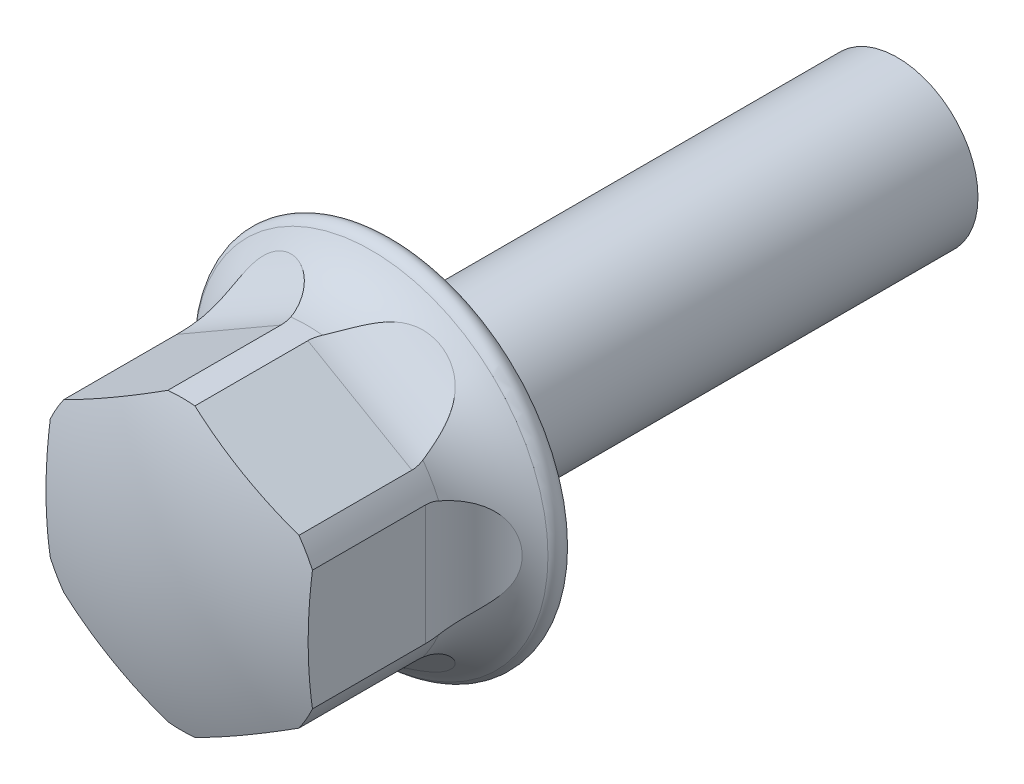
ISO-10303-21;
HEADER;
FILE_DESCRIPTION(('STEP AP214'),'2;1');
FILE_NAME('part.step','',(''),(''),'','','');
FILE_SCHEMA(('AUTOMOTIVE_DESIGN { 1 0 10303 214 1 1 1 1 }'));
ENDSEC;
DATA;
#1=APPLICATION_CONTEXT('core data for automotive mechanical design processes');
#2=APPLICATION_PROTOCOL_DEFINITION('international standard','automotive_design',2000,#1);
#3=PRODUCT_CONTEXT('',#1,'mechanical');
#4=PRODUCT('Part','Part','',(#3));
#5=PRODUCT_RELATED_PRODUCT_CATEGORY('part','',(#4));
#6=PRODUCT_DEFINITION_FORMATION('','',#4);
#7=PRODUCT_DEFINITION_CONTEXT('part definition',#1,'design');
#8=PRODUCT_DEFINITION('design','',#6,#7);
#9=PRODUCT_DEFINITION_SHAPE('','',#8);
#10=(LENGTH_UNIT() NAMED_UNIT(*) SI_UNIT(.MILLI.,.METRE.));
#11=(NAMED_UNIT(*) PLANE_ANGLE_UNIT() SI_UNIT($,.RADIAN.));
#12=(NAMED_UNIT(*) SI_UNIT($,.STERADIAN.) SOLID_ANGLE_UNIT());
#13=UNCERTAINTY_MEASURE_WITH_UNIT(LENGTH_MEASURE(1.E-05),#10,'distance_accuracy_value','');
#14=(GEOMETRIC_REPRESENTATION_CONTEXT(3) GLOBAL_UNCERTAINTY_ASSIGNED_CONTEXT((#13)) GLOBAL_UNIT_ASSIGNED_CONTEXT((#10,
#11,#12)) REPRESENTATION_CONTEXT('',''));
#15=CARTESIAN_POINT('',(0.,0.,0.));
#16=DIRECTION('',(0.,0.,1.));
#17=DIRECTION('',(1.,0.,0.));
#18=AXIS2_PLACEMENT_3D('',#15,#16,#17);
#19=CARTESIAN_POINT('',(0.,0.,0.));
#20=DIRECTION('',(0.,0.,1.));
#21=DIRECTION('',(1.,0.,0.));
#22=AXIS2_PLACEMENT_3D('',#19,#20,#21);
#23=CYLINDRICAL_SURFACE('',#22,7.15);
#24=DIRECTION('',(0.,0.,-1.));
#25=VECTOR('',#24,1.);
#26=CARTESIAN_POINT('',(0.670392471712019,7.1185022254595,11.7));
#27=LINE('',#26,#25);
#28=CARTESIAN_POINT('',(0.670392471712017,7.1185022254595,10.5016762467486));
#29=VERTEX_POINT('',#28);
#30=CARTESIAN_POINT('',(0.670392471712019,7.1185022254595,4.9));
#31=VERTEX_POINT('',#30);
#32=EDGE_CURVE('E307',#29,#31,#27,.T.);
#33=ORIENTED_EDGE('',*,*,#32,.T.);
#34=CARTESIAN_POINT('',(5.82960752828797,4.13982802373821,4.9));
#35=CARTESIAN_POINT('',(5.82960211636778,4.13984064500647,4.99617484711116));
#36=CARTESIAN_POINT('',(5.82476639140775,4.14667190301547,5.09246736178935));
#37=CARTESIAN_POINT('',(5.80553023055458,4.17355648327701,5.28234738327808));
#38=CARTESIAN_POINT('',(5.79110781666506,4.19364018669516,5.37592815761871));
#39=CARTESIAN_POINT('',(5.75316769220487,4.24553649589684,5.55736676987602));
#40=CARTESIAN_POINT('',(5.72968862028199,4.27729924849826,5.64524709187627));
#41=CARTESIAN_POINT('',(5.67424028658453,4.35058609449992,5.81386863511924));
#42=CARTESIAN_POINT('',(5.64227327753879,4.39210759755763,5.89461174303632));
#43=CARTESIAN_POINT('',(5.5670972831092,4.4870837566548,6.05529564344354));
#44=CARTESIAN_POINT('',(5.52310330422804,4.54130162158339,6.13441409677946));
#45=CARTESIAN_POINT('',(5.42674149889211,4.65602944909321,6.28227784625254));
#46=CARTESIAN_POINT('',(5.37436740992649,4.71654410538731,6.35101530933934));
#47=CARTESIAN_POINT('',(5.23381834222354,4.87293573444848,6.51032116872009));
#48=CARTESIAN_POINT('',(5.14092509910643,4.97123117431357,6.5943719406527));
#49=CARTESIAN_POINT('',(4.94114113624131,5.16987038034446,6.74082650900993));
#50=CARTESIAN_POINT('',(4.83421942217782,5.27021825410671,6.80318122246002));
#51=CARTESIAN_POINT('',(4.64973935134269,5.43246313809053,6.88927604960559));
#52=CARTESIAN_POINT('',(4.57550608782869,5.49516978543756,6.91883109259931));
#53=CARTESIAN_POINT('',(4.42293262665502,5.61869995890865,6.97044469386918));
#54=CARTESIAN_POINT('',(4.34459131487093,5.67952296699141,6.99250120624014));
#55=CARTESIAN_POINT('',(4.18434844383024,5.79859476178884,7.0295139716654));
#56=CARTESIAN_POINT('',(4.10244616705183,5.8568430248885,7.04446878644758));
#57=CARTESIAN_POINT('',(3.93555694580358,5.97026591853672,7.0675694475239));
#58=CARTESIAN_POINT('',(3.85056856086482,6.02543908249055,7.07571207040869));
#59=CARTESIAN_POINT('',(3.67706499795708,6.1328804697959,7.08539343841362));
#60=CARTESIAN_POINT('',(3.58852069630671,6.18510850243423,7.08685599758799));
#61=CARTESIAN_POINT('',(3.40941292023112,6.28561421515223,7.08300143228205));
#62=CARTESIAN_POINT('',(3.31885032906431,6.33389358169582,7.07768721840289));
#63=CARTESIAN_POINT('',(3.13626286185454,6.426259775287,7.06017507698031));
#64=CARTESIAN_POINT('',(3.04423811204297,6.47034696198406,7.04797774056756));
#65=CARTESIAN_POINT('',(2.85944107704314,6.55411356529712,7.01645910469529));
#66=CARTESIAN_POINT('',(2.7666689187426,6.59379371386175,6.99713899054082));
#67=CARTESIAN_POINT('',(2.5163643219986,6.6947104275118,6.93490493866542));
#68=CARTESIAN_POINT('',(2.35877045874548,6.75169121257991,6.88493235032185));
#69=CARTESIAN_POINT('',(2.04886790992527,6.8520848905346,6.76087892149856));
#70=CARTESIAN_POINT('',(1.8965521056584,6.89551674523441,6.68683207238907));
#71=CARTESIAN_POINT('',(1.64008295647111,6.96029429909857,6.5330928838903));
#72=CARTESIAN_POINT('',(1.53321305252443,6.98444205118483,6.45913322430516));
#73=CARTESIAN_POINT('',(1.3312306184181,7.02573148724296,6.29493938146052));
#74=CARTESIAN_POINT('',(1.23610235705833,7.04288261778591,6.20472738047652));
#75=CARTESIAN_POINT('',(1.07863661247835,7.06853892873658,6.02607687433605));
#76=CARTESIAN_POINT('',(1.01348065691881,7.07804737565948,5.94027581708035));
#77=CARTESIAN_POINT('',(0.897846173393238,7.09364376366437,5.75893980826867));
#78=CARTESIAN_POINT('',(0.847362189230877,7.09973297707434,5.66340849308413));
#79=CARTESIAN_POINT('',(0.763842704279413,7.10920854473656,5.46407338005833));
#80=CARTESIAN_POINT('',(0.730920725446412,7.11257738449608,5.36022063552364));
#81=CARTESIAN_POINT('',(0.685368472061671,7.11711428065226,5.1480998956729));
#82=CARTESIAN_POINT('',(0.672727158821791,7.118283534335,5.03983433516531));
#83=CARTESIAN_POINT('',(0.668873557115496,7.11864420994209,4.83501332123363));
#84=CARTESIAN_POINT('',(0.675435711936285,7.11804101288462,4.73849376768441));
#85=CARTESIAN_POINT('',(0.704885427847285,7.11518467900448,4.54803038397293));
#86=CARTESIAN_POINT('',(0.727770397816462,7.11293180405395,4.45408614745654));
#87=CARTESIAN_POINT('',(0.788080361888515,7.10649846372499,4.27270193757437));
#88=CARTESIAN_POINT('',(0.825278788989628,7.10234785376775,4.18518473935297));
#89=CARTESIAN_POINT('',(0.912345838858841,7.09168824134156,4.01689711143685));
#90=CARTESIAN_POINT('',(0.962217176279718,7.08517873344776,3.93612813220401));
#91=CARTESIAN_POINT('',(1.07796380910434,7.06853769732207,3.77482528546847));
#92=CARTESIAN_POINT('',(1.14493762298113,7.05811027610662,3.69511407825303));
#93=CARTESIAN_POINT('',(1.28871292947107,7.03328230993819,3.54586442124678));
#94=CARTESIAN_POINT('',(1.3655209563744,7.01887911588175,3.47633280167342));
#95=CARTESIAN_POINT('',(1.56627869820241,6.97741126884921,3.31546538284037));
#96=CARTESIAN_POINT('',(1.69471623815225,6.94760986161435,3.23041808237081));
#97=CARTESIAN_POINT('',(1.96075437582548,6.8772783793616,3.0815549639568));
#98=CARTESIAN_POINT('',(2.09837487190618,6.83672439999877,3.01778717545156));
#99=CARTESIAN_POINT('',(2.32739896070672,6.76126171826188,2.9289485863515));
#100=CARTESIAN_POINT('',(2.41772189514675,6.72952434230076,2.89819544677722));
#101=CARTESIAN_POINT('',(2.59896665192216,6.66162333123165,2.84412740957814));
#102=CARTESIAN_POINT('',(2.68988863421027,6.62545846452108,2.82081458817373));
#103=CARTESIAN_POINT('',(2.87145143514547,6.54881558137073,2.78122250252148));
#104=CARTESIAN_POINT('',(2.96209219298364,6.50833669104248,2.76494466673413));
#105=CARTESIAN_POINT('',(3.14241752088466,6.42321237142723,2.73911377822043));
#106=CARTESIAN_POINT('',(3.23210162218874,6.37856499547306,2.72956388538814));
#107=CARTESIAN_POINT('',(3.41096316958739,6.28475572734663,2.71693789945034));
#108=CARTESIAN_POINT('',(3.50012064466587,6.23554484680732,2.71394330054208));
#109=CARTESIAN_POINT('',(3.67619529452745,6.13338758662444,2.71460764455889));
#110=CARTESIAN_POINT('',(3.76311336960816,6.08044274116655,2.71826386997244));
#111=CARTESIAN_POINT('',(3.93422805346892,5.97115196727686,2.73229823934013));
#112=CARTESIAN_POINT('',(4.01842467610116,5.91480605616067,2.74267634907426));
#113=CARTESIAN_POINT('',(4.18358488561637,5.79916163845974,2.77035982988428));
#114=CARTESIAN_POINT('',(4.26454891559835,5.73986353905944,2.78766424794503));
#115=CARTESIAN_POINT('',(4.41277037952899,5.62650290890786,2.82689552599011));
#116=CARTESIAN_POINT('',(4.48046993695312,5.5727214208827,2.84796587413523));
#117=CARTESIAN_POINT('',(4.61264235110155,5.46382282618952,2.89594527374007));
#118=CARTESIAN_POINT('',(4.67711575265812,5.40870594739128,2.92285333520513));
#119=CARTESIAN_POINT('',(4.80240197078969,5.29777544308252,2.98283389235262));
#120=CARTESIAN_POINT('',(4.86321808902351,5.24196250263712,3.01590071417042));
#121=CARTESIAN_POINT('',(4.98079951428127,5.13037172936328,3.08857321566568));
#122=CARTESIAN_POINT('',(5.03756600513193,5.07459389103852,3.12817697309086));
#123=CARTESIAN_POINT('',(5.17430584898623,4.93586001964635,3.23620146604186));
#124=CARTESIAN_POINT('',(5.25144696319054,4.85346770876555,3.30905020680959));
#125=CARTESIAN_POINT('',(5.39361798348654,4.69496631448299,3.47145127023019));
#126=CARTESIAN_POINT('',(5.45866469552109,4.61884859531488,3.56098006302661));
#127=CARTESIAN_POINT('',(5.56398546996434,4.49111596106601,3.7385577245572));
#128=CARTESIAN_POINT('',(5.60661636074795,4.4375737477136,3.82381115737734));
#129=CARTESIAN_POINT('',(5.68149281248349,4.34129812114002,4.00449170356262));
#130=CARTESIAN_POINT('',(5.71374214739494,4.29856078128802,4.09991510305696));
#131=CARTESIAN_POINT('',(5.7638379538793,4.23110382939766,4.28747356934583));
#132=CARTESIAN_POINT('',(5.782907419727,4.20488539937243,4.37874291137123));
#133=CARTESIAN_POINT('',(5.81158457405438,4.16516569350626,4.56530302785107));
#134=CARTESIAN_POINT('',(5.82121625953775,4.15163216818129,4.66058295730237));
#135=CARTESIAN_POINT('',(5.82841404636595,4.14150782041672,4.80420158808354));
#136=CARTESIAN_POINT('',(5.82961022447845,4.13982173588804,4.85208619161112));
#137=CARTESIAN_POINT('',(5.82960752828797,4.13982802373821,4.9));
#138=B_SPLINE_CURVE_WITH_KNOTS('',3,(#34,#35,#36,#37,#38,#39,#40,#41,#42,#43,#44,#45,#46,#47,
#48,#49,#50,#51,#52,#53,#54,#55,#56,#57,#58,#59,#60,#61,#62,#63,#64,#65,#66,#67,#68,#69,#70,#71,
#72,#73,#74,#75,#76,#77,#78,#79,#80,#81,#82,#83,#84,#85,#86,#87,#88,#89,#90,#91,#92,#93,#94,#95,
#96,#97,#98,#99,#100,#101,#102,#103,#104,#105,#106,#107,#108,#109,#110,#111,#112,#113,#114,#115,
#116,#117,#118,#119,#120,#121,#122,#123,#124,#125,#126,#127,#128,#129,#130,#131,#132,#133,#134,
#135,#136,#137),.UNSPECIFIED.,.T.,.F.,(4,2,2,2,2,2,2,2,2,2,2,2,2,2,2,2,2,2,2,2,2,2,2,2,2,2,2,2,
2,2,2,2,2,2,2,2,2,2,2,2,2,2,2,2,2,2,2,2,2,2,2,4),(0.,0.288374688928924,0.577412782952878,
0.865231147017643,1.15297319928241,1.46835945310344,1.78398250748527,2.25907789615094,
2.73524120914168,3.03959799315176,3.34403775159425,3.64853914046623,3.95318453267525,
4.26129586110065,4.56927490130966,4.87722749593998,5.18512886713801,5.70767059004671,
6.22947769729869,6.62463072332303,7.01924844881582,7.3424018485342,7.66543492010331,
7.99053154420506,8.31545115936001,8.60425778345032,8.8930185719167,9.1773850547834,
9.46181250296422,9.77453409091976,10.0874645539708,10.5555918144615,11.0247686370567,
11.3260849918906,11.6274853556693,11.9289468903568,12.230549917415,12.5358816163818,
12.8410885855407,13.1462940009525,13.451457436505,13.7181920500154,13.9848814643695,
14.2513263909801,14.5176931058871,14.9191569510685,15.3200586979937,15.6467290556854,
15.9732805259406,16.2625967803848,16.5511754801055,16.694842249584),.UNSPECIFIED.);
#139=CARTESIAN_POINT('',(0.78506631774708,7.10676936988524,4.28747881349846));
#140=VERTEX_POINT('',#139);
#141=EDGE_CURVE('E460',#31,#140,#138,.T.);
#142=ORIENTED_EDGE('',*,*,#141,.T.);
#143=CARTESIAN_POINT('',(0.,0.,4.28747881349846));
#144=DIRECTION('',(0.,0.,1.));
#145=DIRECTION('',(1.,0.,0.));
#146=AXIS2_PLACEMENT_3D('',#143,#144,#145);
#147=CIRCLE('',#146,7.15);
#148=CARTESIAN_POINT('',(-0.78506631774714,7.10676936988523,4.28747881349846));
#149=VERTEX_POINT('',#148);
#150=EDGE_CURVE('E360',#149,#140,#147,.F.);
#151=ORIENTED_EDGE('',*,*,#150,.F.);
#152=CARTESIAN_POINT('',(-0.670392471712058,7.1185022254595,4.9));
#153=CARTESIAN_POINT('',(-0.670406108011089,7.11850384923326,4.99617484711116));
#154=CARTESIAN_POINT('',(-0.678740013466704,7.11773161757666,5.09246736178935));
#155=CARTESIAN_POINT('',(-0.711640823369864,7.1145149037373,5.28234738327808));
#156=CARTESIAN_POINT('',(-0.736245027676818,7.11206657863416,5.37592815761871));
#157=CARTESIAN_POINT('',(-0.800158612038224,7.10515762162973,5.55736676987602));
#158=CARTESIAN_POINT('',(-0.839405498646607,7.10070552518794,5.64524709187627));
#159=CARTESIAN_POINT('',(-0.930597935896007,7.08932928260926,5.81386863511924));
#160=CARTESIAN_POINT('',(-0.982540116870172,7.08240579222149,5.89461174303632));
#161=CARTESIAN_POINT('',(-1.102379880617,7.0647895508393,6.05529564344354));
#162=CARTESIAN_POINT('',(-1.17133091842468,7.05379857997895,6.13441409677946));
#163=CARTESIAN_POINT('',(-1.31886903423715,7.02771072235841,6.28227784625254));
#164=CARTESIAN_POINT('',(-1.39746330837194,7.01261075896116,6.35101530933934));
#165=CARTESIAN_POINT('',(-1.60317696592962,6.96908751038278,6.51032116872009));
#166=CARTESIAN_POINT('',(-1.7347499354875,6.93778732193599,6.5943719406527));
#167=CARTESIAN_POINT('',(-2.00666851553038,6.8640889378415,6.74082650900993));
#168=CARTESIAN_POINT('',(-2.147033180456,6.82166595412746,6.80318122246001));
#169=CARTESIAN_POINT('',(-2.3797814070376,6.74302396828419,6.88927604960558));
#170=CARTESIAN_POINT('',(-2.47120358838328,6.71008939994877,6.91883109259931));
#171=CARTESIAN_POINT('',(-2.65447058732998,6.6397219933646,6.97044469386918));
#172=CARTESIAN_POINT('',(-2.74631551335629,6.60228793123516,6.99250120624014));
#173=CARTESIAN_POINT('',(-2.92955614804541,6.52304943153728,7.0295139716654));
#174=CARTESIAN_POINT('',(-3.02095176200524,6.48124411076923,7.04446878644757));
#175=CARTESIAN_POINT('',(-3.20262347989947,6.39342525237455,7.0675694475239));
#176=CARTESIAN_POINT('',(-3.29289903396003,6.34740973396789,7.07571207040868));
#177=CARTESIAN_POINT('',(-3.47269778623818,6.25087193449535,7.08539343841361));
#178=CARTESIAN_POINT('',(-3.56220074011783,6.20030433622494,7.08685599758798));
#179=CARTESIAN_POINT('',(-3.73879512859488,6.09544530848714,7.08300143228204));
#180=CARTESIAN_POINT('',(-3.82588758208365,6.04115548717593,7.07768721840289));
#181=CARTESIAN_POINT('',(-3.99717278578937,5.9292131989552,7.0601750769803));
#182=CARTESIAN_POINT('',(-4.08136578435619,5.87156102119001,7.04797774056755));
#183=CARTESIAN_POINT('',(-4.24630830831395,5.75340539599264,7.01645910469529));
#184=CARTESIAN_POINT('',(-4.32705840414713,5.69290242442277,6.99713899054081));
#185=CARTESIAN_POINT('',(-4.53960714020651,5.52659064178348,6.93490493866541));
#186=CARTESIAN_POINT('',(-4.66775087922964,5.4186007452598,6.88493235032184));
#187=CARTESIAN_POINT('',(-4.90964562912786,5.2004141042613,6.76087892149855));
#188=CARTESIAN_POINT('',(-5.02341662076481,5.09022067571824,6.68683207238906));
#189=CARTESIAN_POINT('',(-5.20775020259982,4.90050065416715,6.53309288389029));
#190=CARTESIAN_POINT('',(-5.28209772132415,4.82002247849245,6.45913322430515));
#191=CARTESIAN_POINT('',(-5.41884663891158,4.66574527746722,6.29493938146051));
#192=CARTESIAN_POINT('',(-5.4812640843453,4.59193735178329,6.20472738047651));
#193=CARTESIAN_POINT('',(-5.58221597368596,4.46839617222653,6.02607687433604));
#194=CARTESIAN_POINT('',(-5.62302850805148,4.41672368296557,5.94027581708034));
#195=CARTESIAN_POINT('',(-5.69435261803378,4.32437947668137,5.75893980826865));
#196=CARTESIAN_POINT('',(-5.72486802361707,4.2837036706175,5.66340849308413));
#197=CARTESIAN_POINT('',(-5.77483384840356,4.21611145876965,5.46407338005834));
#198=CARTESIAN_POINT('',(-5.79421233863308,4.18928460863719,5.36022063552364));
#199=CARTESIAN_POINT('',(-5.82091753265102,4.15210364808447,5.14809989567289));
#200=CARTESIAN_POINT('',(-5.82825079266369,4.14174057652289,5.03983433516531));
#201=CARTESIAN_POINT('',(-5.83048994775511,4.13858359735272,4.83501332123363));
#202=CARTESIAN_POINT('',(-5.82668648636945,4.14396499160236,4.73849376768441));
#203=CARTESIAN_POINT('',(-5.80948797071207,4.16804102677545,4.54803038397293));
#204=CARTESIAN_POINT('',(-5.79609443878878,4.18673355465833,4.45408614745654));
#205=CARTESIAN_POINT('',(-5.76036802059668,4.23574684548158,4.27270193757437));
#206=CARTESIAN_POINT('',(-5.73817427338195,4.26588632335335,4.18518473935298));
#207=CARTESIAN_POINT('',(-5.68540925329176,4.33595879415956,4.01689711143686));
#208=CARTESIAN_POINT('',(-5.65483618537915,4.37589388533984,3.93612813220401));
#209=CARTESIAN_POINT('',(-5.5825513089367,4.46781289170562,3.77482528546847));
#210=CARTESIAN_POINT('',(-5.54003399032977,4.52060020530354,3.69511407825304));
#211=CARTESIAN_POINT('',(-5.44664468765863,4.6326992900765,3.54586442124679));
#212=CARTESIAN_POINT('',(-5.39576714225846,4.69201539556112,3.47633280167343));
#213=CARTESIAN_POINT('',(-5.25947606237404,4.84514277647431,3.31546538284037));
#214=CARTESIAN_POINT('',(-5.16944851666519,4.94147224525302,3.23041808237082));
#215=CARTESIAN_POINT('',(-4.97552059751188,5.13670228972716,3.08155496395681));
#216=CARTESIAN_POINT('',(-4.87158957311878,5.23560814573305,3.01778717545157));
#217=CARTESIAN_POINT('',(-4.69172492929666,5.39621748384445,2.9289485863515));
#218=CARTESIAN_POINT('',(-4.61907808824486,5.45857075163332,2.89819544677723));
#219=CARTESIAN_POINT('',(-4.46965170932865,5.581582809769,2.84412740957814));
#220=CARTESIAN_POINT('',(-4.39287102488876,5.64224112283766,2.82081458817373));
#221=CARTESIAN_POINT('',(-4.23571494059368,5.76115767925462,2.78122250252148));
#222=CARTESIAN_POINT('',(-4.15533881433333,5.81941543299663,2.76494466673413));
#223=CARTESIAN_POINT('',(-3.99145632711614,5.93301958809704,2.73911377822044));
#224=CARTESIAN_POINT('',(-3.90794851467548,5.98836461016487,2.72956388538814));
#225=CARTESIAN_POINT('',(-3.73727653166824,6.09635861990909,2.71693789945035));
#226=CARTESIAN_POINT('',(-3.65007992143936,6.14896581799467,2.71394330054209));
#227=CARTESIAN_POINT('',(-3.47357181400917,6.25037230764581,2.7146076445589));
#228=CARTESIAN_POINT('',(-3.38426119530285,6.2991731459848,2.71826386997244));
#229=CARTESIAN_POINT('',(-3.20405526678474,6.39271742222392,2.73229823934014));
#230=CARTESIAN_POINT('',(-3.11315996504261,6.43746088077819,2.74267634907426));
#231=CARTESIAN_POINT('',(-2.93042885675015,6.52267160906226,2.77035982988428));
#232=CARTESIAN_POINT('',(-2.83859318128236,6.56313946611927,2.78766424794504));
#233=CARTESIAN_POINT('',(-2.66630926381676,6.63482270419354,2.82689552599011));
#234=CARTESIAN_POINT('',(-2.58588335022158,6.66656149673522,2.84796587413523));
#235=CARTESIAN_POINT('',(-2.42548819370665,6.72657686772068,2.89594527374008));
#236=CARTESIAN_POINT('',(-2.34551887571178,6.75485403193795,2.92285333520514));
#237=CARTESIAN_POINT('',(-2.18680713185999,6.80788982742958,2.98283389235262));
#238=CARTESIAN_POINT('',(-2.10806364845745,6.83265166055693,3.01590071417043));
#239=CARTESIAN_POINT('',(-1.95263249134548,6.87868477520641,3.08857321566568));
#240=CARTESIAN_POINT('',(-1.87594422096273,6.89995707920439,3.12817697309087));
#241=CARTESIAN_POINT('',(-1.6874272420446,6.94901032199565,3.23620146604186));
#242=CARTESIAN_POINT('',(-1.57750285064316,6.97462033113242,3.30905020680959));
#243=CARTESIAN_POINT('',(-1.36915110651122,7.01849334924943,3.4714512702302));
#244=CARTESIAN_POINT('',(-1.27070787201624,7.03676659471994,3.56098006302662));
#245=CARTESIAN_POINT('',(-1.10742777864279,7.06411074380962,3.7385577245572));
#246=CARTESIAN_POINT('',(-1.03974341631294,7.07425907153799,3.82381115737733));
#247=CARTESIAN_POINT('',(-0.918928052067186,7.09096616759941,4.00449170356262));
#248=CARTESIAN_POINT('',(-0.865791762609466,7.09752624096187,4.09991510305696));
#249=CARTESIAN_POINT('',(-0.782324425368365,7.10718200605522,4.28747356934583));
#250=CARTESIAN_POINT('',(-0.75008386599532,7.11058743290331,4.37874291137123));
#251=CARTESIAN_POINT('',(-0.701347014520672,7.11556272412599,4.56530302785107));
#252=CARTESIAN_POINT('',(-0.684810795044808,7.11713724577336,4.66058295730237));
#253=CARTESIAN_POINT('',(-0.672443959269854,7.11830853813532,4.80420158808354));
#254=CARTESIAN_POINT('',(-0.670385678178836,7.11850141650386,4.85208619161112));
#255=CARTESIAN_POINT('',(-0.670392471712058,7.1185022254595,4.9));
#256=B_SPLINE_CURVE_WITH_KNOTS('',3,(#152,#153,#154,#155,#156,#157,#158,#159,#160,#161,#162,
#163,#164,#165,#166,#167,#168,#169,#170,#171,#172,#173,#174,#175,#176,#177,#178,#179,#180,#181,
#182,#183,#184,#185,#186,#187,#188,#189,#190,#191,#192,#193,#194,#195,#196,#197,#198,#199,#200,
#201,#202,#203,#204,#205,#206,#207,#208,#209,#210,#211,#212,#213,#214,#215,#216,#217,#218,#219,
#220,#221,#222,#223,#224,#225,#226,#227,#228,#229,#230,#231,#232,#233,#234,#235,#236,#237,#238,
#239,#240,#241,#242,#243,#244,#245,#246,#247,#248,#249,#250,#251,#252,#253,#254,#255),
.UNSPECIFIED.,.T.,.F.,(4,2,2,2,2,2,2,2,2,2,2,2,2,2,2,2,2,2,2,2,2,2,2,2,2,2,2,2,2,2,2,2,2,2,2,2,
2,2,2,2,2,2,2,2,2,2,2,2,2,2,2,4),(0.,0.288374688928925,0.57741278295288,0.865231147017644,
1.15297319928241,1.46835945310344,1.78398250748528,2.25907789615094,2.73524120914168,
3.03959799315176,3.34403775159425,3.64853914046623,3.95318453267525,4.26129586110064,
4.56927490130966,4.87722749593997,5.18512886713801,5.7076705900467,6.22947769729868,
6.62463072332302,7.01924844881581,7.34240184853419,7.66543492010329,7.99053154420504,
8.31545115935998,8.6042577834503,8.89301857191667,9.17738505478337,9.46181250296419,
9.77453409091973,10.0874645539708,10.5555918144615,11.0247686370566,11.3260849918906,
11.6274853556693,11.9289468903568,12.230549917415,12.5358816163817,12.8410885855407,
13.1462940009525,13.451457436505,13.7181920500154,13.9848814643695,14.25132639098,
14.517693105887,14.9191569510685,15.3200586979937,15.6467290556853,15.9732805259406,
16.2625967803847,16.5511754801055,16.6948422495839),.UNSPECIFIED.);
#257=CARTESIAN_POINT('',(-0.670392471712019,7.11850222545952,4.9));
#258=VERTEX_POINT('',#257);
#259=EDGE_CURVE('E312',#149,#258,#256,.T.);
#260=ORIENTED_EDGE('',*,*,#259,.T.);
#261=DIRECTION('',(0.,0.,-1.));
#262=VECTOR('',#261,1.);
#263=CARTESIAN_POINT('',(-0.670392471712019,7.1185022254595,11.7));
#264=LINE('',#263,#262);
#265=CARTESIAN_POINT('',(-0.67039247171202,7.1185022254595,10.5016762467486));
#266=VERTEX_POINT('',#265);
#267=EDGE_CURVE('E310',#266,#258,#264,.T.);
#268=ORIENTED_EDGE('',*,*,#267,.F.);
#269=CARTESIAN_POINT('',(0.,0.,10.5016762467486));
#270=DIRECTION('',(0.,0.,1.));
#271=DIRECTION('',(1.,0.,0.));
#272=AXIS2_PLACEMENT_3D('',#269,#270,#271);
#273=CIRCLE('',#272,7.15);
#274=EDGE_CURVE('E194',#29,#266,#273,.T.);
#275=ORIENTED_EDGE('',*,*,#274,.F.);
#276=EDGE_LOOP('',(#33,#142,#151,#260,#268,#275));
#277=FACE_BOUND('',#276,.T.);
#278=ADVANCED_FACE('F16',(#277),#23,.T.);
#279=DIRECTION('',(0.,0.,-1.));
#280=VECTOR('',#279,1.);
#281=CARTESIAN_POINT('',(-5.82960752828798,4.1398280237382,11.7));
#282=LINE('',#281,#280);
#283=CARTESIAN_POINT('',(-5.82960752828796,4.13982802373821,10.5016762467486));
#284=VERTEX_POINT('',#283);
#285=CARTESIAN_POINT('',(-5.82960752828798,4.1398280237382,4.9));
#286=VERTEX_POINT('',#285);
#287=EDGE_CURVE('E317',#284,#286,#282,.T.);
#288=ORIENTED_EDGE('',*,*,#287,.T.);
#289=CARTESIAN_POINT('',(-5.76210965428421,4.23327205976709,4.28747881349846));
#290=VERTEX_POINT('',#289);
#291=EDGE_CURVE('E650',#286,#290,#256,.T.);
#292=ORIENTED_EDGE('',*,*,#291,.T.);
#293=CARTESIAN_POINT('',(-6.54717597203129,2.87349731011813,4.28747881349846));
#294=VERTEX_POINT('',#293);
#295=EDGE_CURVE('E346',#294,#290,#147,.F.);
#296=ORIENTED_EDGE('',*,*,#295,.F.);
#297=CARTESIAN_POINT('',(-7.15,0.,2.71425070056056));
#298=CARTESIAN_POINT('',(-7.1500021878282,0.0976074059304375,2.71425253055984));
#299=CARTESIAN_POINT('',(-7.14799956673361,0.195190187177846,2.71730889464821));
#300=CARTESIAN_POINT('',(-7.14002999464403,0.389798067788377,2.72959418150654));
#301=CARTESIAN_POINT('',(-7.13406390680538,0.486823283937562,2.73882176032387));
#302=CARTESIAN_POINT('',(-7.11825669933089,0.679948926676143,2.76364141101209));
#303=CARTESIAN_POINT('',(-7.10840742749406,0.776046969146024,2.77924687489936));
#304=CARTESIAN_POINT('',(-7.08503296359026,0.966436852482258,2.81709444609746));
#305=CARTESIAN_POINT('',(-7.07150941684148,1.06072948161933,2.83933358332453));
#306=CARTESIAN_POINT('',(-7.04094946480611,1.24762597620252,2.89105004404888));
#307=CARTESIAN_POINT('',(-7.02388412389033,1.34020862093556,2.92058739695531));
#308=CARTESIAN_POINT('',(-6.98674520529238,1.52200482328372,2.98727981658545));
#309=CARTESIAN_POINT('',(-6.96667103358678,1.61121771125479,3.02443638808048));
#310=CARTESIAN_POINT('',(-6.92418362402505,1.78497971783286,3.10676918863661));
#311=CARTESIAN_POINT('',(-6.90177735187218,1.86954163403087,3.15192180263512));
#312=CARTESIAN_POINT('',(-6.85541078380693,2.03299274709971,3.25077392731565));
#313=CARTESIAN_POINT('',(-6.83145162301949,2.11188600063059,3.30446723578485));
#314=CARTESIAN_POINT('',(-6.7775604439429,2.27959396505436,3.43391584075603));
#315=CARTESIAN_POINT('',(-6.74749436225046,2.36666355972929,3.51191819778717));
#316=CARTESIAN_POINT('',(-6.68905169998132,2.52713148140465,3.68151997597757));
#317=CARTESIAN_POINT('',(-6.66067434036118,2.60053614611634,3.77311305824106));
#318=CARTESIAN_POINT('',(-6.60828884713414,2.73093801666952,3.96993038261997));
#319=CARTESIAN_POINT('',(-6.58432518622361,2.78777126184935,4.07527683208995));
#320=CARTESIAN_POINT('',(-6.54425262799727,2.88060103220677,4.29618793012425));
#321=CARTESIAN_POINT('',(-6.52813504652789,2.91662060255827,4.41174111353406));
#322=CARTESIAN_POINT('',(-6.50776716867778,2.96175259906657,4.63099565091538));
#323=CARTESIAN_POINT('',(-6.50211171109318,2.97406252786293,4.73391418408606));
#324=CARTESIAN_POINT('',(-6.49887467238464,2.98113293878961,4.94046262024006));
#325=CARTESIAN_POINT('',(-6.50128902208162,2.97590226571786,5.04409213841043));
#326=CARTESIAN_POINT('',(-6.51333186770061,2.94943728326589,5.23943354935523));
#327=CARTESIAN_POINT('',(-6.52230414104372,2.9296577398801,5.33138945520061));
#328=CARTESIAN_POINT('',(-6.54584015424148,2.87668402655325,5.51056307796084));
#329=CARTESIAN_POINT('',(-6.56040379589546,2.84349009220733,5.59778087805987));
#330=CARTESIAN_POINT('',(-6.59455477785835,2.76338665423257,5.76917113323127));
#331=CARTESIAN_POINT('',(-6.61432649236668,2.71596232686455,5.85306436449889));
#332=CARTESIAN_POINT('',(-6.65692438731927,2.60981462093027,6.01247117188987));
#333=CARTESIAN_POINT('',(-6.67975217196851,2.55108530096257,6.08798030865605));
#334=CARTESIAN_POINT('',(-6.73651563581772,2.39810603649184,6.25916618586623));
#335=CARTESIAN_POINT('',(-6.771168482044,2.29916456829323,6.35042009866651));
#336=CARTESIAN_POINT('',(-6.83951512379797,2.08709714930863,6.51519621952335));
#337=CARTESIAN_POINT('',(-6.87320679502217,1.97394237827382,6.58868148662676));
#338=CARTESIAN_POINT('',(-6.92577548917,1.77836802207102,6.69642781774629));
#339=CARTESIAN_POINT('',(-6.94575381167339,1.69881081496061,6.73547518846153));
#340=CARTESIAN_POINT('',(-6.98351823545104,1.53621317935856,6.80682440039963));
#341=CARTESIAN_POINT('',(-7.00130366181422,1.45317168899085,6.83912416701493));
#342=CARTESIAN_POINT('',(-7.05067491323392,1.19996971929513,6.92650296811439));
#343=CARTESIAN_POINT('',(-7.07829061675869,1.02567768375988,6.97209013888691));
#344=CARTESIAN_POINT('',(-7.12106388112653,0.667942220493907,7.04112953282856));
#345=CARTESIAN_POINT('',(-7.13597009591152,0.484386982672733,7.06413648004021));
#346=CARTESIAN_POINT('',(-7.15145962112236,0.115072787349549,7.08803541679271));
#347=CARTESIAN_POINT('',(-7.15203403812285,-0.070687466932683,7.08891367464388));
#348=CARTESIAN_POINT('',(-7.14157176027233,-0.363626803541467,7.07277886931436));
#349=CARTESIAN_POINT('',(-7.13525145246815,-0.471446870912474,7.06303436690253));
#350=CARTESIAN_POINT('',(-7.11784924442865,-0.685756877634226,7.03572705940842));
#351=CARTESIAN_POINT('',(-7.10676626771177,-0.792246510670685,7.01816248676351));
#352=CARTESIAN_POINT('',(-7.08010918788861,-1.00290384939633,6.97484764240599));
#353=CARTESIAN_POINT('',(-7.06453845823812,-1.10707323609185,6.94910351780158));
#354=CARTESIAN_POINT('',(-7.02934492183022,-1.31211077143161,6.88891000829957));
#355=CARTESIAN_POINT('',(-7.0097239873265,-1.41298042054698,6.85446464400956));
#356=CARTESIAN_POINT('',(-6.95872664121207,-1.64870018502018,6.76098237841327));
#357=CARTESIAN_POINT('',(-6.92574464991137,-1.78152733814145,6.69759057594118));
#358=CARTESIAN_POINT('',(-6.85569658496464,-2.03447549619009,6.55094671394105));
#359=CARTESIAN_POINT('',(-6.81863752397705,-2.15461764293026,6.46772847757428));
#360=CARTESIAN_POINT('',(-6.75207476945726,-2.35385692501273,6.29978569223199));
#361=CARTESIAN_POINT('',(-6.7226111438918,-2.43628411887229,6.21901267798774));
#362=CARTESIAN_POINT('',(-6.66609488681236,-2.58691713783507,6.04435984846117));
#363=CARTESIAN_POINT('',(-6.63903980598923,-2.65513750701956,5.95049360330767));
#364=CARTESIAN_POINT('',(-6.59387360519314,-2.76520256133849,5.76591009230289));
#365=CARTESIAN_POINT('',(-6.57503009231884,-2.8094653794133,5.67681878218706));
#366=CARTESIAN_POINT('',(-6.54291277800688,-2.88347541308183,5.49182120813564));
#367=CARTESIAN_POINT('',(-6.52963681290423,-2.91322826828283,5.39591760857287));
#368=CARTESIAN_POINT('',(-6.50999900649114,-2.9568567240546,5.19944531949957));
#369=CARTESIAN_POINT('',(-6.50366441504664,-2.97066976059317,5.09885984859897));
#370=CARTESIAN_POINT('',(-6.49872372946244,-2.9814645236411,4.89660015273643));
#371=CARTESIAN_POINT('',(-6.5001162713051,-2.9784492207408,4.79492612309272));
#372=CARTESIAN_POINT('',(-6.5100993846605,-2.95655638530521,4.60085612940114));
#373=CARTESIAN_POINT('',(-6.51818509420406,-2.93879115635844,4.50830506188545));
#374=CARTESIAN_POINT('',(-6.54011517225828,-2.88965582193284,4.32763822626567));
#375=CARTESIAN_POINT('',(-6.5539595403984,-2.85828571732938,4.2395224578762));
#376=CARTESIAN_POINT('',(-6.58672949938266,-2.78195297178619,4.06674379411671));
#377=CARTESIAN_POINT('',(-6.60581198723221,-2.7365640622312,3.98230047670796));
#378=CARTESIAN_POINT('',(-6.64722739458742,-2.63437134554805,3.82155293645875));
#379=CARTESIAN_POINT('',(-6.66956186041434,-2.57756210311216,3.74525261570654));
#380=CARTESIAN_POINT('',(-6.72508197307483,-2.42984858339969,3.57292089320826));
#381=CARTESIAN_POINT('',(-6.75905836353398,-2.33435752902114,3.48106442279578));
#382=CARTESIAN_POINT('',(-6.82648817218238,-2.129152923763,3.31462534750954));
#383=CARTESIAN_POINT('',(-6.85994035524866,-2.01941019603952,3.24007907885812));
#384=CARTESIAN_POINT('',(-6.93326626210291,-1.75401787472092,3.08678490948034));
#385=CARTESIAN_POINT('',(-6.97192421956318,-1.59467060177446,3.01387400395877));
#386=CARTESIAN_POINT('',(-7.0392357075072,-1.26494434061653,2.89304053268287));
#387=CARTESIAN_POINT('',(-7.06788333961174,-1.09455891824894,2.84513269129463));
#388=CARTESIAN_POINT('',(-7.10997674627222,-0.770595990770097,2.77653605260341));
#389=CARTESIAN_POINT('',(-7.12493314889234,-0.617780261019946,2.75308309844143));
#390=CARTESIAN_POINT('',(-7.14494096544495,-0.309955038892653,2.72194227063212));
#391=CARTESIAN_POINT('',(-7.14999652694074,-0.154946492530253,2.71424779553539));
#392=CARTESIAN_POINT('',(-7.15,0.,2.71425070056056));
#393=B_SPLINE_CURVE_WITH_KNOTS('',3,(#297,#298,#299,#300,#301,#302,#303,#304,#305,#306,#307,
#308,#309,#310,#311,#312,#313,#314,#315,#316,#317,#318,#319,#320,#321,#322,#323,#324,#325,#326,
#327,#328,#329,#330,#331,#332,#333,#334,#335,#336,#337,#338,#339,#340,#341,#342,#343,#344,#345,
#346,#347,#348,#349,#350,#351,#352,#353,#354,#355,#356,#357,#358,#359,#360,#361,#362,#363,#364,
#365,#366,#367,#368,#369,#370,#371,#372,#373,#374,#375,#376,#377,#378,#379,#380,#381,#382,#383,
#384,#385,#386,#387,#388,#389,#390,#391,#392),.UNSPECIFIED.,.T.,.F.,(4,2,2,2,2,2,2,2,2,2,2,2,2,
2,2,2,2,2,2,2,2,2,2,2,2,2,2,2,2,2,2,2,2,2,2,2,2,2,2,2,2,2,2,2,2,2,2,4),(0.,0.292710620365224,
0.585357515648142,0.878622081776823,1.17175554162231,1.46738540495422,1.76307371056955,
2.05790288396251,2.3525189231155,2.71323284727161,3.07377905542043,3.43778011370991,
3.80137736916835,4.11106777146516,4.42060203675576,4.70278866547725,4.98497033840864,
5.27893458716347,5.57305375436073,5.98775092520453,6.40330297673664,6.6755091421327,
6.94779887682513,7.49219180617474,8.0471163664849,8.60238527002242,8.92738191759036,
9.25245206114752,9.5772784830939,9.90195508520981,10.3527677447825,10.8028167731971,
11.1587849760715,11.5143869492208,11.8168436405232,12.1191826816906,12.4227044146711,
12.7261725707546,13.0086370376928,13.2911014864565,13.5831792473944,13.8753963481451,
14.2834987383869,14.6924501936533,15.227938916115,15.7637426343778,16.2285997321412,
16.693262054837),.UNSPECIFIED.);
#394=CARTESIAN_POINT('',(-6.5,2.9786742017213,4.9));
#395=VERTEX_POINT('',#394);
#396=EDGE_CURVE('E338',#294,#395,#393,.T.);
#397=ORIENTED_EDGE('',*,*,#396,.T.);
#398=DIRECTION('',(0.,0.,-1.));
#399=VECTOR('',#398,1.);
#400=CARTESIAN_POINT('',(-6.5,2.9786742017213,11.7));
#401=LINE('',#400,#399);
#402=CARTESIAN_POINT('',(-6.5,2.97867420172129,10.5016762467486));
#403=VERTEX_POINT('',#402);
#404=EDGE_CURVE('E330',#403,#395,#401,.T.);
#405=ORIENTED_EDGE('',*,*,#404,.F.);
#406=EDGE_CURVE('E291',#284,#403,#273,.T.);
#407=ORIENTED_EDGE('',*,*,#406,.F.);
#408=EDGE_LOOP('',(#288,#292,#296,#397,#405,#407));
#409=FACE_BOUND('',#408,.T.);
#410=ADVANCED_FACE('F243',(#409),#23,.T.);
#411=CARTESIAN_POINT('',(5.76210965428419,4.23327205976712,4.28747881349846));
#412=VERTEX_POINT('',#411);
#413=CARTESIAN_POINT('',(6.54717597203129,2.87349731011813,4.28747881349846));
#414=VERTEX_POINT('',#413);
#415=EDGE_CURVE('E193',#412,#414,#147,.F.);
#416=ORIENTED_EDGE('',*,*,#415,.F.);
#417=CARTESIAN_POINT('',(5.82960752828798,4.1398280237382,4.9));
#418=VERTEX_POINT('',#417);
#419=EDGE_CURVE('E461',#412,#418,#138,.T.);
#420=ORIENTED_EDGE('',*,*,#419,.T.);
#421=DIRECTION('',(0.,0.,-1.));
#422=VECTOR('',#421,1.);
#423=CARTESIAN_POINT('',(5.82960752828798,4.1398280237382,11.7));
#424=LINE('',#423,#422);
#425=CARTESIAN_POINT('',(5.82960752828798,4.1398280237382,10.5016762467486));
#426=VERTEX_POINT('',#425);
#427=EDGE_CURVE('E639',#426,#418,#424,.T.);
#428=ORIENTED_EDGE('',*,*,#427,.F.);
#429=CARTESIAN_POINT('',(6.5,2.97867420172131,10.5016762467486));
#430=VERTEX_POINT('',#429);
#431=EDGE_CURVE('E190',#430,#426,#273,.T.);
#432=ORIENTED_EDGE('',*,*,#431,.F.);
#433=DIRECTION('',(0.,0.,-1.));
#434=VECTOR('',#433,1.);
#435=CARTESIAN_POINT('',(6.5,2.9786742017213,11.7));
#436=LINE('',#435,#434);
#437=CARTESIAN_POINT('',(6.5,2.9786742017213,4.9));
#438=VERTEX_POINT('',#437);
#439=EDGE_CURVE('E320',#430,#438,#436,.T.);
#440=ORIENTED_EDGE('',*,*,#439,.T.);
#441=CARTESIAN_POINT('',(6.54717597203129,-2.87349731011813,4.28747881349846));
#442=CARTESIAN_POINT('',(6.54027784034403,-2.88921060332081,4.33197927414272));
#443=CARTESIAN_POINT('',(6.5340502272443,-2.90325095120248,4.37715740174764));
#444=CARTESIAN_POINT('',(6.52306080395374,-2.92785970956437,4.46863359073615));
#445=CARTESIAN_POINT('',(6.51829932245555,-2.93842734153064,4.51493190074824));
#446=CARTESIAN_POINT('',(6.50642284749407,-2.96468425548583,4.65491934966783));
#447=CARTESIAN_POINT('',(6.50168460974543,-2.97499727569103,4.7498975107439));
#448=CARTESIAN_POINT('',(6.49906589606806,-2.98071311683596,4.94052326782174));
#449=CARTESIAN_POINT('',(6.50119754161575,-2.97608958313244,5.03617174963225));
#450=CARTESIAN_POINT('',(6.51211544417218,-2.95212137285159,5.22516385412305));
#451=CARTESIAN_POINT('',(6.52089869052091,-2.93278335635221,5.31850849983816));
#452=CARTESIAN_POINT('',(6.54416898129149,-2.88047794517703,5.49974943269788));
#453=CARTESIAN_POINT('',(6.55861367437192,-2.84761166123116,5.58768069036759));
#454=CARTESIAN_POINT('',(6.59193249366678,-2.76960610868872,5.75701169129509));
#455=CARTESIAN_POINT('',(6.61080903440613,-2.72446014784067,5.8384078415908));
#456=CARTESIAN_POINT('',(6.65342705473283,-2.61876583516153,6.00071320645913));
#457=CARTESIAN_POINT('',(6.67745880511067,-2.55716982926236,6.08086030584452));
#458=CARTESIAN_POINT('',(6.72715924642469,-2.42341396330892,6.23114548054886));
#459=CARTESIAN_POINT('',(6.7528287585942,-2.35124877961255,6.30127847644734));
#460=CARTESIAN_POINT('',(6.8166736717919,-2.16096746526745,6.46332933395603));
#461=CARTESIAN_POINT('',(6.85482957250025,-2.03763120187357,6.54914175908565));
#462=CARTESIAN_POINT('',(6.92684301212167,-1.77753603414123,6.69987976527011));
#463=CARTESIAN_POINT('',(6.96069051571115,-1.64074706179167,6.76475710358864));
#464=CARTESIAN_POINT('',(7.0104937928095,-1.40861132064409,6.85575197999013));
#465=CARTESIAN_POINT('',(7.02853203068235,-1.31582279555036,6.88744894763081));
#466=CARTESIAN_POINT('',(7.06120008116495,-1.12742279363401,6.94345637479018));
#467=CARTESIAN_POINT('',(7.0758289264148,-1.03181052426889,6.96776473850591));
#468=CARTESIAN_POINT('',(7.1013227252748,-0.838582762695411,7.00940420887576));
#469=CARTESIAN_POINT('',(7.11218698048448,-0.740966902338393,7.02673402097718));
#470=CARTESIAN_POINT('',(7.12992908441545,-0.544385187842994,7.0547382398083));
#471=CARTESIAN_POINT('',(7.13680506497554,-0.445418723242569,7.0654095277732));
#472=CARTESIAN_POINT('',(7.14649420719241,-0.245496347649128,7.08038514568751));
#473=CARTESIAN_POINT('',(7.14925267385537,-0.144531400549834,7.08460377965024));
#474=CARTESIAN_POINT('',(7.15048214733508,0.0574449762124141,7.08648836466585));
#475=CARTESIAN_POINT('',(7.14895486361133,0.158456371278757,7.08415692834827));
#476=CARTESIAN_POINT('',(7.14164483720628,0.3599644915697,7.07290029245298));
#477=CARTESIAN_POINT('',(7.13586183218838,0.460461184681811,7.0639746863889));
#478=CARTESIAN_POINT('',(7.12015139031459,0.660291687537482,7.03935453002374));
#479=CARTESIAN_POINT('',(7.11022443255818,0.75962563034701,7.02366076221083));
#480=CARTESIAN_POINT('',(7.08768659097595,0.946079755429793,6.98722889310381));
#481=CARTESIAN_POINT('',(7.07546807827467,1.03338520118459,6.96719541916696));
#482=CARTESIAN_POINT('',(7.04810859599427,1.20594102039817,6.92117861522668));
#483=CARTESIAN_POINT('',(7.03296808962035,1.29119171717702,6.89519622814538));
#484=CARTESIAN_POINT('',(7.00009288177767,1.45893551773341,6.83694829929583));
#485=CARTESIAN_POINT('',(6.98236046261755,1.54143096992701,6.80468827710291));
#486=CARTESIAN_POINT('',(6.94473605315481,1.70294610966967,6.73349795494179));
#487=CARTESIAN_POINT('',(6.92484470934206,1.78196682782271,6.69456964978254));
#488=CARTESIAN_POINT('',(6.87301996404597,1.9744271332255,6.58822096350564));
#489=CARTESIAN_POINT('',(6.84006279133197,2.08518252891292,6.51631921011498));
#490=CARTESIAN_POINT('',(6.77317496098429,2.29314568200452,6.35544634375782));
#491=CARTESIAN_POINT('',(6.73924576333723,2.3903725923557,6.2664997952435));
#492=CARTESIAN_POINT('',(6.68014750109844,2.55029364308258,6.08982254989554));
#493=CARTESIAN_POINT('',(6.65453233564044,2.61604272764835,6.00501995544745));
#494=CARTESIAN_POINT('',(6.60729525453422,2.73315618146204,5.82492777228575));
#495=CARTESIAN_POINT('',(6.58567175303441,2.78452626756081,5.72964237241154));
#496=CARTESIAN_POINT('',(6.54858481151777,2.87067531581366,5.5298371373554));
#497=CARTESIAN_POINT('',(6.53316493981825,2.90533726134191,5.42525807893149));
#498=CARTESIAN_POINT('',(6.51063109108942,2.95549758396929,5.21069552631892));
#499=CARTESIAN_POINT('',(6.50351407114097,2.97100298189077,5.10071402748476));
#500=CARTESIAN_POINT('',(6.49882033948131,2.9812490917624,4.89297012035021));
#501=CARTESIAN_POINT('',(6.50019625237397,2.97826921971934,4.79533429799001));
#502=CARTESIAN_POINT('',(6.50993356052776,2.95692431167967,4.60220516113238));
#503=CARTESIAN_POINT('',(6.51828365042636,2.93858417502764,4.50670863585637));
#504=CARTESIAN_POINT('',(6.53227909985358,2.90720944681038,4.39239784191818));
#505=CARTESIAN_POINT('',(6.53505028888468,2.90097710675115,4.37120003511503));
#506=CARTESIAN_POINT('',(6.54089196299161,2.88778219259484,4.32911418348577));
#507=CARTESIAN_POINT('',(6.54396193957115,2.88082085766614,4.30822567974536));
#508=CARTESIAN_POINT('',(6.54717597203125,2.87349731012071,4.28747881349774));
#509=B_SPLINE_CURVE_WITH_KNOTS('',3,(#441,#442,#443,#444,#445,#446,#447,#448,#449,#450,#451,
#452,#453,#454,#455,#456,#457,#458,#459,#460,#461,#462,#463,#464,#465,#466,#467,#468,#469,#470,
#471,#472,#473,#474,#475,#476,#477,#478,#479,#480,#481,#482,#483,#484,#485,#486,#487,#488,#489,
#490,#491,#492,#493,#494,#495,#496,#497,#498,#499,#500,#501,#502,#503,#504,#505,#506,#507,#508),
.UNSPECIFIED.,.F.,.F.,(4,2,2,2,2,2,2,2,2,2,2,2,2,2,2,2,2,2,2,2,2,2,2,2,2,2,2,2,2,2,2,2,2,4),(0.,
0.143009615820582,0.286051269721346,0.571510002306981,0.857472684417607,1.14330601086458,
1.42704071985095,1.71093037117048,2.0214539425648,2.33213446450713,2.79465783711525,
3.25823955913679,3.5569887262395,3.85582255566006,4.15471179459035,4.45374092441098,
4.75670791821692,5.05955408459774,5.36241892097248,5.66524875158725,5.93621072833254,
6.20712978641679,6.47781170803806,6.74841279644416,7.15514982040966,7.56130501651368,
7.89093994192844,8.22044362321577,8.55222263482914,8.88388001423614,9.17552566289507,
9.46669946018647,9.53349619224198,9.60018116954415),.UNSPECIFIED.);
#510=EDGE_CURVE('E375',#438,#414,#509,.T.);
#511=ORIENTED_EDGE('',*,*,#510,.T.);
#512=EDGE_LOOP('',(#416,#420,#428,#432,#440,#511));
#513=FACE_BOUND('',#512,.T.);
#514=ADVANCED_FACE('F250',(#513),#23,.T.);
#515=DIRECTION('',(0.,0.,-1.));
#516=VECTOR('',#515,1.);
#517=CARTESIAN_POINT('',(-0.670392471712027,-7.1185022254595,11.7));
#518=LINE('',#517,#516);
#519=CARTESIAN_POINT('',(-0.670392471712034,-7.1185022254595,10.5016762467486));
#520=VERTEX_POINT('',#519);
#521=CARTESIAN_POINT('',(-0.670392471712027,-7.1185022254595,4.9));
#522=VERTEX_POINT('',#521);
#523=EDGE_CURVE('E40',#520,#522,#518,.T.);
#524=ORIENTED_EDGE('',*,*,#523,.T.);
#525=CARTESIAN_POINT('',(-5.82960752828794,-4.13982802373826,4.9));
#526=CARTESIAN_POINT('',(-5.82960211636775,-4.13984064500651,4.99617484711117));
#527=CARTESIAN_POINT('',(-5.82476639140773,-4.14667190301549,5.09246736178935));
#528=CARTESIAN_POINT('',(-5.80553023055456,-4.17355648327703,5.28234738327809));
#529=CARTESIAN_POINT('',(-5.79110781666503,-4.1936401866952,5.37592815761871));
#530=CARTESIAN_POINT('',(-5.75316769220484,-4.24553649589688,5.55736676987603));
#531=CARTESIAN_POINT('',(-5.72968862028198,-4.27729924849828,5.64524709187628));
#532=CARTESIAN_POINT('',(-5.67424028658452,-4.35058609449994,5.81386863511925));
#533=CARTESIAN_POINT('',(-5.64227327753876,-4.39210759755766,5.89461174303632));
#534=CARTESIAN_POINT('',(-5.56709728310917,-4.48708375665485,6.05529564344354));
#535=CARTESIAN_POINT('',(-5.52310330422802,-4.54130162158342,6.13441409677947));
#536=CARTESIAN_POINT('',(-5.42674149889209,-4.65602944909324,6.28227784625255));
#537=CARTESIAN_POINT('',(-5.37436740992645,-4.71654410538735,6.35101530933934));
#538=CARTESIAN_POINT('',(-5.23381834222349,-4.87293573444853,6.51032116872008));
#539=CARTESIAN_POINT('',(-5.1409250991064,-4.9712311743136,6.59437194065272));
#540=CARTESIAN_POINT('',(-4.94114113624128,-5.16987038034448,6.74082650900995));
#541=CARTESIAN_POINT('',(-4.83421942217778,-5.27021825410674,6.80318122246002));
#542=CARTESIAN_POINT('',(-4.64973935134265,-5.43246313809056,6.88927604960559));
#543=CARTESIAN_POINT('',(-4.57550608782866,-5.49516978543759,6.91883109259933));
#544=CARTESIAN_POINT('',(-4.42293262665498,-5.61869995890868,6.97044469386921));
#545=CARTESIAN_POINT('',(-4.34459131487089,-5.67952296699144,6.99250120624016));
#546=CARTESIAN_POINT('',(-4.1843484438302,-5.79859476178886,7.02951397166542));
#547=CARTESIAN_POINT('',(-4.1024461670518,-5.85684302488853,7.04446878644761));
#548=CARTESIAN_POINT('',(-3.93555694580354,-5.97026591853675,7.06756944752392));
#549=CARTESIAN_POINT('',(-3.85056856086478,-6.02543908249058,7.07571207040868));
#550=CARTESIAN_POINT('',(-3.67706499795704,-6.13288046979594,7.08539343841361));
#551=CARTESIAN_POINT('',(-3.58852069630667,-6.18510850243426,7.086855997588));
#552=CARTESIAN_POINT('',(-3.40941292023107,-6.28561421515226,7.08300143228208));
#553=CARTESIAN_POINT('',(-3.31885032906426,-6.33389358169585,7.07768721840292));
#554=CARTESIAN_POINT('',(-3.13626286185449,-6.42625977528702,7.06017507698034));
#555=CARTESIAN_POINT('',(-3.04423811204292,-6.47034696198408,7.04797774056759));
#556=CARTESIAN_POINT('',(-2.85944107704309,-6.55411356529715,7.01645910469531));
#557=CARTESIAN_POINT('',(-2.76666891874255,-6.59379371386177,6.99713899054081));
#558=CARTESIAN_POINT('',(-2.51636432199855,-6.69471042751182,6.9349049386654));
#559=CARTESIAN_POINT('',(-2.35877045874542,-6.75169121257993,6.88493235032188));
#560=CARTESIAN_POINT('',(-2.04886790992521,-6.85208489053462,6.7608789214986));
#561=CARTESIAN_POINT('',(-1.89655210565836,-6.89551674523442,6.68683207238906));
#562=CARTESIAN_POINT('',(-1.64008295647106,-6.96029429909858,6.5330928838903));
#563=CARTESIAN_POINT('',(-1.53321305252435,-6.98444205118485,6.45913322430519));
#564=CARTESIAN_POINT('',(-1.33123061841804,-7.02573148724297,6.29493938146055));
#565=CARTESIAN_POINT('',(-1.23610235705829,-7.04288261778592,6.20472738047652));
#566=CARTESIAN_POINT('',(-1.07863661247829,-7.06853892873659,6.02607687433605));
#567=CARTESIAN_POINT('',(-1.01348065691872,-7.07804737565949,5.94027581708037));
#568=CARTESIAN_POINT('',(-0.897846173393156,-7.09364376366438,5.75893980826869));
#569=CARTESIAN_POINT('',(-0.847362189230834,-7.09973297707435,5.66340849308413));
#570=CARTESIAN_POINT('',(-0.763842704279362,-7.10920854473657,5.46407338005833));
#571=CARTESIAN_POINT('',(-0.730920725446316,-7.11257738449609,5.36022063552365));
#572=CARTESIAN_POINT('',(-0.685368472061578,-7.11711428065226,5.14809989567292));
#573=CARTESIAN_POINT('',(-0.672727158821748,-7.118283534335,5.03983433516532));
#574=CARTESIAN_POINT('',(-0.668873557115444,-7.11864420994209,4.83501332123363));
#575=CARTESIAN_POINT('',(-0.675435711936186,-7.11804101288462,4.73849376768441));
#576=CARTESIAN_POINT('',(-0.704885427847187,-7.1151846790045,4.54803038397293));
#577=CARTESIAN_POINT('',(-0.727770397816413,-7.11293180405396,4.45408614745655));
#578=CARTESIAN_POINT('',(-0.78808036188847,-7.106498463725,4.27270193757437));
#579=CARTESIAN_POINT('',(-0.825278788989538,-7.10234785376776,4.18518473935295));
#580=CARTESIAN_POINT('',(-0.912345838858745,-7.09168824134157,4.01689711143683));
#581=CARTESIAN_POINT('',(-0.962217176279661,-7.08517873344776,3.93612813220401));
#582=CARTESIAN_POINT('',(-1.07796380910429,-7.06853769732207,3.77482528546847));
#583=CARTESIAN_POINT('',(-1.14493762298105,-7.05811027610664,3.69511407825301));
#584=CARTESIAN_POINT('',(-1.28871292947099,-7.0332823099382,3.54586442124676));
#585=CARTESIAN_POINT('',(-1.36552095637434,-7.01887911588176,3.47633280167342));
#586=CARTESIAN_POINT('',(-1.56627869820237,-6.97741126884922,3.31546538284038));
#587=CARTESIAN_POINT('',(-1.69471623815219,-6.94760986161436,3.23041808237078));
#588=CARTESIAN_POINT('',(-1.96075437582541,-6.87727837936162,3.08155496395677));
#589=CARTESIAN_POINT('',(-2.09837487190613,-6.83672439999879,3.01778717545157));
#590=CARTESIAN_POINT('',(-2.32739896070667,-6.7612617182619,2.9289485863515));
#591=CARTESIAN_POINT('',(-2.4177218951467,-6.72952434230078,2.8981954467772));
#592=CARTESIAN_POINT('',(-2.5989666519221,-6.66162333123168,2.8441274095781));
#593=CARTESIAN_POINT('',(-2.68988863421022,-6.6254584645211,2.8208145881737));
#594=CARTESIAN_POINT('',(-2.87145143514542,-6.54881558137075,2.78122250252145));
#595=CARTESIAN_POINT('',(-2.96209219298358,-6.50833669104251,2.76494466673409));
#596=CARTESIAN_POINT('',(-3.14241752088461,-6.42321237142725,2.73911377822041));
#597=CARTESIAN_POINT('',(-3.2321016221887,-6.37856499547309,2.72956388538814));
#598=CARTESIAN_POINT('',(-3.41096316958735,-6.28475572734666,2.71693789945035));
#599=CARTESIAN_POINT('',(-3.50012064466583,-6.23554484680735,2.71394330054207));
#600=CARTESIAN_POINT('',(-3.67619529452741,-6.13338758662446,2.71460764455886));
#601=CARTESIAN_POINT('',(-3.76311336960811,-6.08044274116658,2.71826386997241));
#602=CARTESIAN_POINT('',(-3.93422805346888,-5.97115196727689,2.73229823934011));
#603=CARTESIAN_POINT('',(-4.01842467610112,-5.9148060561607,2.74267634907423));
#604=CARTESIAN_POINT('',(-4.18358488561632,-5.79916163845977,2.77035982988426));
#605=CARTESIAN_POINT('',(-4.26454891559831,-5.73986353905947,2.78766424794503));
#606=CARTESIAN_POINT('',(-4.41277037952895,-5.62650290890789,2.8268955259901));
#607=CARTESIAN_POINT('',(-4.48046993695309,-5.57272142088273,2.84796587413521));
#608=CARTESIAN_POINT('',(-4.61264235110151,-5.46382282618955,2.89594527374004));
#609=CARTESIAN_POINT('',(-4.67711575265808,-5.40870594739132,2.92285333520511));
#610=CARTESIAN_POINT('',(-4.80240197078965,-5.29777544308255,2.98283389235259));
#611=CARTESIAN_POINT('',(-4.86321808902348,-5.24196250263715,3.01590071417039));
#612=CARTESIAN_POINT('',(-4.98079951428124,-5.13037172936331,3.08857321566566));
#613=CARTESIAN_POINT('',(-5.03756600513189,-5.07459389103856,3.12817697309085));
#614=CARTESIAN_POINT('',(-5.17430584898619,-4.93586001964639,3.23620146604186));
#615=CARTESIAN_POINT('',(-5.25144696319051,-4.85346770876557,3.30905020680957));
#616=CARTESIAN_POINT('',(-5.39361798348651,-4.69496631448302,3.47145127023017));
#617=CARTESIAN_POINT('',(-5.45866469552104,-4.61884859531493,3.56098006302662));
#618=CARTESIAN_POINT('',(-5.56398546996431,-4.49111596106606,3.73855772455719));
#619=CARTESIAN_POINT('',(-5.60661636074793,-4.43757374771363,3.82381115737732));
#620=CARTESIAN_POINT('',(-5.68149281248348,-4.34129812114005,4.0044917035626));
#621=CARTESIAN_POINT('',(-5.71374214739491,-4.29856078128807,4.09991510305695));
#622=CARTESIAN_POINT('',(-5.76383795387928,-4.2311038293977,4.28747356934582));
#623=CARTESIAN_POINT('',(-5.78290741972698,-4.20488539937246,4.37874291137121));
#624=CARTESIAN_POINT('',(-5.81158457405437,-4.16516569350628,4.56530302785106));
#625=CARTESIAN_POINT('',(-5.82121625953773,-4.15163216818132,4.66058295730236));
#626=CARTESIAN_POINT('',(-5.82841404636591,-4.14150782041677,4.80420158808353));
#627=CARTESIAN_POINT('',(-5.82961022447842,-4.13982173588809,4.85208619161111));
#628=CARTESIAN_POINT('',(-5.82960752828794,-4.13982802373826,4.9));
#629=B_SPLINE_CURVE_WITH_KNOTS('',3,(#525,#526,#527,#528,#529,#530,#531,#532,#533,#534,#535,
#536,#537,#538,#539,#540,#541,#542,#543,#544,#545,#546,#547,#548,#549,#550,#551,#552,#553,#554,
#555,#556,#557,#558,#559,#560,#561,#562,#563,#564,#565,#566,#567,#568,#569,#570,#571,#572,#573,
#574,#575,#576,#577,#578,#579,#580,#581,#582,#583,#584,#585,#586,#587,#588,#589,#590,#591,#592,
#593,#594,#595,#596,#597,#598,#599,#600,#601,#602,#603,#604,#605,#606,#607,#608,#609,#610,#611,
#612,#613,#614,#615,#616,#617,#618,#619,#620,#621,#622,#623,#624,#625,#626,#627,#628),
.UNSPECIFIED.,.T.,.F.,(4,2,2,2,2,2,2,2,2,2,2,2,2,2,2,2,2,2,2,2,2,2,2,2,2,2,2,2,2,2,2,2,2,2,2,2,
2,2,2,2,2,2,2,2,2,2,2,2,2,2,2,4),(0.,0.288374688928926,0.577412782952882,0.865231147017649,
1.15297319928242,1.46835945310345,1.78398250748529,2.25907789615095,2.7352412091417,
3.03959799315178,3.34403775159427,3.64853914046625,3.95318453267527,4.26129586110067,
4.56927490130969,4.87722749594,5.18512886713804,5.70767059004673,6.22947769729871,
6.62463072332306,7.01924844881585,7.34240184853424,7.66543492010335,7.9905315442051,
8.31545115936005,8.60425778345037,8.89301857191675,9.17738505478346,9.46181250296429,
9.77453409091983,10.0874645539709,10.5555918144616,11.0247686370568,11.3260849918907,
11.6274853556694,11.9289468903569,12.2305499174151,12.5358816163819,12.8410885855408,
13.1462940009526,13.4514574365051,13.7181920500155,13.9848814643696,14.2513263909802,
14.5176931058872,14.9191569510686,15.3200586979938,15.6467290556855,15.9732805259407,
16.2625967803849,16.5511754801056,16.6948422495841),.UNSPECIFIED.);
#630=CARTESIAN_POINT('',(-0.785066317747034,-7.10676936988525,4.28747881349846));
#631=VERTEX_POINT('',#630);
#632=EDGE_CURVE('E148',#522,#631,#629,.T.);
#633=ORIENTED_EDGE('',*,*,#632,.T.);
#634=CARTESIAN_POINT('',(0.78506631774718,-7.10676936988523,4.28747881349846));
#635=VERTEX_POINT('',#634);
#636=EDGE_CURVE('E200',#635,#631,#147,.F.);
#637=ORIENTED_EDGE('',*,*,#636,.F.);
#638=CARTESIAN_POINT('',(0.670392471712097,-7.11850222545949,4.9));
#639=CARTESIAN_POINT('',(0.670406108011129,-7.11850384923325,4.99617484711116));
#640=CARTESIAN_POINT('',(0.678740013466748,-7.11773161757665,5.09246736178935));
#641=CARTESIAN_POINT('',(0.711640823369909,-7.1145149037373,5.28234738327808));
#642=CARTESIAN_POINT('',(0.736245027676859,-7.11206657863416,5.37592815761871));
#643=CARTESIAN_POINT('',(0.800158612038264,-7.10515762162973,5.55736676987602));
#644=CARTESIAN_POINT('',(0.83940549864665,-7.10070552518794,5.64524709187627));
#645=CARTESIAN_POINT('',(0.930597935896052,-7.08932928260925,5.81386863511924));
#646=CARTESIAN_POINT('',(0.982540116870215,-7.08240579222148,5.89461174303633));
#647=CARTESIAN_POINT('',(1.10237988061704,-7.06478955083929,6.05529564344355));
#648=CARTESIAN_POINT('',(1.17133091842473,-7.05379857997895,6.13441409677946));
#649=CARTESIAN_POINT('',(1.3188690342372,-7.0277107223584,6.28227784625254));
#650=CARTESIAN_POINT('',(1.39746330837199,-7.01261075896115,6.35101530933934));
#651=CARTESIAN_POINT('',(1.60317696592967,-6.96908751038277,6.51032116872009));
#652=CARTESIAN_POINT('',(1.73474993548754,-6.93778732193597,6.5943719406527));
#653=CARTESIAN_POINT('',(2.00666851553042,-6.86408893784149,6.74082650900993));
#654=CARTESIAN_POINT('',(2.14703318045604,-6.82166595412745,6.80318122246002));
#655=CARTESIAN_POINT('',(2.37978140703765,-6.74302396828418,6.88927604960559));
#656=CARTESIAN_POINT('',(2.47120358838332,-6.71008939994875,6.91883109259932));
#657=CARTESIAN_POINT('',(2.65447058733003,-6.63972199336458,6.97044469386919));
#658=CARTESIAN_POINT('',(2.74631551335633,-6.60228793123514,6.99250120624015));
#659=CARTESIAN_POINT('',(2.92955614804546,-6.52304943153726,7.02951397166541));
#660=CARTESIAN_POINT('',(3.02095176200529,-6.48124411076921,7.04446878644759));
#661=CARTESIAN_POINT('',(3.20262347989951,-6.39342525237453,7.06756944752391));
#662=CARTESIAN_POINT('',(3.29289903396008,-6.34740973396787,7.07571207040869));
#663=CARTESIAN_POINT('',(3.47269778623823,-6.25087193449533,7.08539343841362));
#664=CARTESIAN_POINT('',(3.56220074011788,-6.20030433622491,7.08685599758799));
#665=CARTESIAN_POINT('',(3.73879512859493,-6.09544530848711,7.08300143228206));
#666=CARTESIAN_POINT('',(3.8258875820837,-6.0411554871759,7.0776872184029));
#667=CARTESIAN_POINT('',(3.99717278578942,-5.92921319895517,7.06017507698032));
#668=CARTESIAN_POINT('',(4.08136578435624,-5.87156102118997,7.04797774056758));
#669=CARTESIAN_POINT('',(4.246308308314,-5.75340539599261,7.0164591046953));
#670=CARTESIAN_POINT('',(4.32705840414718,-5.69290242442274,6.99713899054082));
#671=CARTESIAN_POINT('',(4.53960714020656,-5.52659064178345,6.93490493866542));
#672=CARTESIAN_POINT('',(4.66775087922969,-5.41860074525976,6.88493235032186));
#673=CARTESIAN_POINT('',(4.90964562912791,-5.20041410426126,6.76087892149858));
#674=CARTESIAN_POINT('',(5.02341662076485,-5.0902206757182,6.68683207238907));
#675=CARTESIAN_POINT('',(5.20775020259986,-4.9005006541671,6.5330928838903));
#676=CARTESIAN_POINT('',(5.2820977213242,-4.82002247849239,6.45913322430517));
#677=CARTESIAN_POINT('',(5.41884663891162,-4.66574527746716,6.29493938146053));
#678=CARTESIAN_POINT('',(5.48126408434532,-4.59193735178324,6.20472738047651));
#679=CARTESIAN_POINT('',(5.582215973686,-4.46839617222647,6.02607687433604));
#680=CARTESIAN_POINT('',(5.62302850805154,-4.4167236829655,5.94027581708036));
#681=CARTESIAN_POINT('',(5.69435261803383,-4.32437947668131,5.75893980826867));
#682=CARTESIAN_POINT('',(5.7248680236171,-4.28370367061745,5.66340849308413));
#683=CARTESIAN_POINT('',(5.77483384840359,-4.2161114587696,5.46407338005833));
#684=CARTESIAN_POINT('',(5.79421233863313,-4.18928460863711,5.36022063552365));
#685=CARTESIAN_POINT('',(5.82091753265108,-4.15210364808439,5.14809989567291));
#686=CARTESIAN_POINT('',(5.82825079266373,-4.14174057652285,5.03983433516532));
#687=CARTESIAN_POINT('',(5.83048994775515,-4.13858359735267,4.83501332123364));
#688=CARTESIAN_POINT('',(5.82668648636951,-4.14396499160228,4.73849376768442));
#689=CARTESIAN_POINT('',(5.80948797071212,-4.16804102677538,4.54803038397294));
#690=CARTESIAN_POINT('',(5.79609443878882,-4.18673355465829,4.45408614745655));
#691=CARTESIAN_POINT('',(5.76036802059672,-4.23574684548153,4.27270193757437));
#692=CARTESIAN_POINT('',(5.738174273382,-4.26588632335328,4.18518473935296));
#693=CARTESIAN_POINT('',(5.68540925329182,-4.33595879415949,4.01689711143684));
#694=CARTESIAN_POINT('',(5.65483618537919,-4.37589388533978,3.93612813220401));
#695=CARTESIAN_POINT('',(5.58255130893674,-4.46781289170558,3.77482528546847));
#696=CARTESIAN_POINT('',(5.54003399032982,-4.52060020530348,3.69511407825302));
#697=CARTESIAN_POINT('',(5.44664468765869,-4.63269929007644,3.54586442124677));
#698=CARTESIAN_POINT('',(5.3957671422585,-4.69201539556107,3.47633280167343));
#699=CARTESIAN_POINT('',(5.25947606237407,-4.84514277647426,3.31546538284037));
#700=CARTESIAN_POINT('',(5.16944851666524,-4.94147224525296,3.2304180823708));
#701=CARTESIAN_POINT('',(4.97552059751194,-5.13670228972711,3.08155496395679));
#702=CARTESIAN_POINT('',(4.87158957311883,-5.235608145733,3.01778717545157));
#703=CARTESIAN_POINT('',(4.69172492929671,-5.39621748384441,2.9289485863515));
#704=CARTESIAN_POINT('',(4.61907808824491,-5.45857075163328,2.89819544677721));
#705=CARTESIAN_POINT('',(4.46965170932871,-5.58158280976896,2.84412740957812));
#706=CARTESIAN_POINT('',(4.39287102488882,-5.64224112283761,2.82081458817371));
#707=CARTESIAN_POINT('',(4.23571494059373,-5.76115767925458,2.78122250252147));
#708=CARTESIAN_POINT('',(4.15533881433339,-5.81941543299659,2.76494466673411));
#709=CARTESIAN_POINT('',(3.9914563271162,-5.933019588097,2.73911377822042));
#710=CARTESIAN_POINT('',(3.90794851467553,-5.98836461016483,2.72956388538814));
#711=CARTESIAN_POINT('',(3.7372765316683,-6.09635861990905,2.71693789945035));
#712=CARTESIAN_POINT('',(3.65007992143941,-6.14896581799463,2.71394330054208));
#713=CARTESIAN_POINT('',(3.47357181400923,-6.25037230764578,2.71460764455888));
#714=CARTESIAN_POINT('',(3.3842611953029,-6.29917314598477,2.71826386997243));
#715=CARTESIAN_POINT('',(3.2040552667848,-6.39271742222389,2.73229823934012));
#716=CARTESIAN_POINT('',(3.11315996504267,-6.43746088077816,2.74267634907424));
#717=CARTESIAN_POINT('',(2.93042885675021,-6.52267160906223,2.77035982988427));
#718=CARTESIAN_POINT('',(2.83859318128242,-6.56313946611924,2.78766424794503));
#719=CARTESIAN_POINT('',(2.66630926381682,-6.63482270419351,2.82689552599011));
#720=CARTESIAN_POINT('',(2.58588335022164,-6.66656149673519,2.84796587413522));
#721=CARTESIAN_POINT('',(2.42548819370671,-6.72657686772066,2.89594527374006));
#722=CARTESIAN_POINT('',(2.34551887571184,-6.75485403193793,2.92285333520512));
#723=CARTESIAN_POINT('',(2.18680713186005,-6.80788982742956,2.98283389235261));
#724=CARTESIAN_POINT('',(2.10806364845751,-6.83265166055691,3.01590071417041));
#725=CARTESIAN_POINT('',(1.95263249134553,-6.87868477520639,3.08857321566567));
#726=CARTESIAN_POINT('',(1.87594422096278,-6.89995707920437,3.12817697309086));
#727=CARTESIAN_POINT('',(1.68742724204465,-6.94901032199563,3.23620146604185));
#728=CARTESIAN_POINT('',(1.57750285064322,-6.9746203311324,3.30905020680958));
#729=CARTESIAN_POINT('',(1.36915110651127,-7.01849334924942,3.47145127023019));
#730=CARTESIAN_POINT('',(1.27070787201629,-7.03676659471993,3.56098006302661));
#731=CARTESIAN_POINT('',(1.10742777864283,-7.06411074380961,3.73855772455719));
#732=CARTESIAN_POINT('',(1.03974341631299,-7.07425907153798,3.82381115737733));
#733=CARTESIAN_POINT('',(0.918928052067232,-7.09096616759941,4.00449170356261));
#734=CARTESIAN_POINT('',(0.865791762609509,-7.09752624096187,4.09991510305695));
#735=CARTESIAN_POINT('',(0.782324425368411,-7.10718200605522,4.28747356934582));
#736=CARTESIAN_POINT('',(0.750083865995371,-7.1105874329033,4.37874291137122));
#737=CARTESIAN_POINT('',(0.701347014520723,-7.11556272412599,4.56530302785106));
#738=CARTESIAN_POINT('',(0.684810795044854,-7.11713724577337,4.66058295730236));
#739=CARTESIAN_POINT('',(0.672443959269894,-7.11830853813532,4.80420158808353));
#740=CARTESIAN_POINT('',(0.670385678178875,-7.11850141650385,4.85208619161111));
#741=CARTESIAN_POINT('',(0.670392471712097,-7.11850222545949,4.9));
#742=B_SPLINE_CURVE_WITH_KNOTS('',3,(#638,#639,#640,#641,#642,#643,#644,#645,#646,#647,#648,
#649,#650,#651,#652,#653,#654,#655,#656,#657,#658,#659,#660,#661,#662,#663,#664,#665,#666,#667,
#668,#669,#670,#671,#672,#673,#674,#675,#676,#677,#678,#679,#680,#681,#682,#683,#684,#685,#686,
#687,#688,#689,#690,#691,#692,#693,#694,#695,#696,#697,#698,#699,#700,#701,#702,#703,#704,#705,
#706,#707,#708,#709,#710,#711,#712,#713,#714,#715,#716,#717,#718,#719,#720,#721,#722,#723,#724,
#725,#726,#727,#728,#729,#730,#731,#732,#733,#734,#735,#736,#737,#738,#739,#740,#741),
.UNSPECIFIED.,.T.,.F.,(4,2,2,2,2,2,2,2,2,2,2,2,2,2,2,2,2,2,2,2,2,2,2,2,2,2,2,2,2,2,2,2,2,2,2,2,
2,2,2,2,2,2,2,2,2,2,2,2,2,2,2,4),(0.,0.288374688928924,0.577412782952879,0.865231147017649,
1.15297319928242,1.46835945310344,1.78398250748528,2.25907789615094,2.73524120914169,
3.03959799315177,3.34403775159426,3.64853914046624,3.95318453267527,4.26129586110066,
4.56927490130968,4.87722749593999,5.18512886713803,5.70767059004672,6.2294776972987,
6.62463072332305,7.01924844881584,7.34240184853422,7.66543492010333,7.99053154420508,
8.31545115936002,8.60425778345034,8.89301857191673,9.17738505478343,9.46181250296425,
9.77453409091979,10.0874645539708,10.5555918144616,11.0247686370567,11.3260849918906,
11.6274853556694,11.9289468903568,12.2305499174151,12.5358816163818,12.8410885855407,
13.1462940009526,13.4514574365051,13.7181920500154,13.9848814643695,14.2513263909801,
14.5176931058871,14.9191569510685,15.3200586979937,15.6467290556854,15.9732805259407,
16.2625967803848,16.5511754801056,16.694842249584),.UNSPECIFIED.);
#743=CARTESIAN_POINT('',(0.670392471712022,-7.11850222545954,4.9));
#744=VERTEX_POINT('',#743);
#745=EDGE_CURVE('E459',#635,#744,#742,.T.);
#746=ORIENTED_EDGE('',*,*,#745,.T.);
#747=DIRECTION('',(0.,0.,-1.));
#748=VECTOR('',#747,1.);
#749=CARTESIAN_POINT('',(0.670392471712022,-7.1185022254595,11.7));
#750=LINE('',#749,#748);
#751=CARTESIAN_POINT('',(0.670392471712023,-7.1185022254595,10.5016762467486));
#752=VERTEX_POINT('',#751);
#753=EDGE_CURVE('E182',#752,#744,#750,.T.);
#754=ORIENTED_EDGE('',*,*,#753,.F.);
#755=EDGE_CURVE('E282',#520,#752,#273,.T.);
#756=ORIENTED_EDGE('',*,*,#755,.F.);
#757=EDGE_LOOP('',(#524,#633,#637,#746,#754,#756));
#758=FACE_BOUND('',#757,.T.);
#759=ADVANCED_FACE('F264',(#758),#23,.T.);
#760=DIRECTION('',(0.,0.,-1.));
#761=VECTOR('',#760,1.);
#762=CARTESIAN_POINT('',(5.82960752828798,-4.1398280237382,11.7));
#763=LINE('',#762,#761);
#764=CARTESIAN_POINT('',(5.82960752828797,-4.13982802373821,10.5016762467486));
#765=VERTEX_POINT('',#764);
#766=CARTESIAN_POINT('',(5.82960752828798,-4.1398280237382,4.9));
#767=VERTEX_POINT('',#766);
#768=EDGE_CURVE('E32',#765,#767,#763,.T.);
#769=ORIENTED_EDGE('',*,*,#768,.T.);
#770=CARTESIAN_POINT('',(5.76210965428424,-4.23327205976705,4.28747881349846));
#771=VERTEX_POINT('',#770);
#772=EDGE_CURVE('E274',#767,#771,#742,.T.);
#773=ORIENTED_EDGE('',*,*,#772,.T.);
#774=CARTESIAN_POINT('',(6.54717597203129,-2.87349731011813,4.28747881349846));
#775=VERTEX_POINT('',#774);
#776=EDGE_CURVE('E195',#775,#771,#147,.F.);
#777=ORIENTED_EDGE('',*,*,#776,.F.);
#778=CARTESIAN_POINT('',(6.5,-2.9786742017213,4.9));
#779=VERTEX_POINT('',#778);
#780=EDGE_CURVE('E377',#775,#779,#509,.T.);
#781=ORIENTED_EDGE('',*,*,#780,.T.);
#782=DIRECTION('',(0.,0.,-1.));
#783=VECTOR('',#782,1.);
#784=CARTESIAN_POINT('',(6.5,-2.9786742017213,11.7));
#785=LINE('',#784,#783);
#786=CARTESIAN_POINT('',(6.5,-2.9786742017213,10.5016762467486));
#787=VERTEX_POINT('',#786);
#788=EDGE_CURVE('E279',#787,#779,#785,.T.);
#789=ORIENTED_EDGE('',*,*,#788,.F.);
#790=EDGE_CURVE('E189',#765,#787,#273,.T.);
#791=ORIENTED_EDGE('',*,*,#790,.F.);
#792=EDGE_LOOP('',(#769,#773,#777,#781,#789,#791));
#793=FACE_BOUND('',#792,.T.);
#794=ADVANCED_FACE('F257',(#793),#23,.T.);
#795=DIRECTION('',(0.,0.,-1.));
#796=VECTOR('',#795,1.);
#797=CARTESIAN_POINT('',(-6.5,-2.9786742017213,11.7));
#798=LINE('',#797,#796);
#799=CARTESIAN_POINT('',(-6.5,-2.97867420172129,10.5016762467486));
#800=VERTEX_POINT('',#799);
#801=CARTESIAN_POINT('',(-6.5,-2.9786742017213,4.9));
#802=VERTEX_POINT('',#801);
#803=EDGE_CURVE('E151',#800,#802,#798,.T.);
#804=ORIENTED_EDGE('',*,*,#803,.T.);
#805=CARTESIAN_POINT('',(-6.54717597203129,-2.87349731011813,4.28747881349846));
#806=VERTEX_POINT('',#805);
#807=EDGE_CURVE('E340',#802,#806,#393,.T.);
#808=ORIENTED_EDGE('',*,*,#807,.T.);
#809=CARTESIAN_POINT('',(-5.76210965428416,-4.23327205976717,4.28747881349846));
#810=VERTEX_POINT('',#809);
#811=EDGE_CURVE('E163',#810,#806,#147,.F.);
#812=ORIENTED_EDGE('',*,*,#811,.F.);
#813=CARTESIAN_POINT('',(-5.82960752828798,-4.13982802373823,4.9));
#814=VERTEX_POINT('',#813);
#815=EDGE_CURVE('E145',#810,#814,#629,.T.);
#816=ORIENTED_EDGE('',*,*,#815,.T.);
#817=DIRECTION('',(0.,0.,-1.));
#818=VECTOR('',#817,1.);
#819=CARTESIAN_POINT('',(-5.82960752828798,-4.1398280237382,11.7));
#820=LINE('',#819,#818);
#821=CARTESIAN_POINT('',(-5.82960752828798,-4.1398280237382,10.5016762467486));
#822=VERTEX_POINT('',#821);
#823=EDGE_CURVE('E152',#822,#814,#820,.T.);
#824=ORIENTED_EDGE('',*,*,#823,.F.);
#825=EDGE_CURVE('E287',#800,#822,#273,.T.);
#826=ORIENTED_EDGE('',*,*,#825,.F.);
#827=EDGE_LOOP('',(#804,#808,#812,#816,#824,#826));
#828=FACE_BOUND('',#827,.T.);
#829=ADVANCED_FACE('F158',(#828),#23,.T.);
#830=CARTESIAN_POINT('',(0.,0.,-10.23));
#831=DIRECTION('',(0.,0.,1.));
#832=DIRECTION('',(-1.,0.,0.));
#833=AXIS2_PLACEMENT_3D('',#830,#831,#832);
#834=SPHERICAL_SURFACE('',#833,21.93);
#835=CARTESIAN_POINT('',(-3.25,-5.62916512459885,-10.23));
#836=DIRECTION('',(-0.5,-0.866025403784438,0.));
#837=DIRECTION('',(0.866025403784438,-0.5,0.));
#838=AXIS2_PLACEMENT_3D('',#835,#836,#837);
#839=CIRCLE('',#838,20.9445673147);
#840=EDGE_CURVE('E168',#520,#822,#839,.T.);
#841=ORIENTED_EDGE('',*,*,#840,.F.);
#842=ORIENTED_EDGE('',*,*,#755,.T.);
#843=CARTESIAN_POINT('',(3.25,-5.62916512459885,-10.23));
#844=DIRECTION('',(0.5,-0.866025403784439,0.));
#845=DIRECTION('',(0.866025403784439,0.5,0.));
#846=AXIS2_PLACEMENT_3D('',#843,#844,#845);
#847=CIRCLE('',#846,20.9445673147);
#848=EDGE_CURVE('E199',#765,#752,#847,.T.);
#849=ORIENTED_EDGE('',*,*,#848,.F.);
#850=ORIENTED_EDGE('',*,*,#790,.T.);
#851=CARTESIAN_POINT('',(6.5,0.,-10.23));
#852=DIRECTION('',(1.,0.,0.));
#853=DIRECTION('',(0.,0.,-1.));
#854=AXIS2_PLACEMENT_3D('',#851,#852,#853);
#855=CIRCLE('',#854,20.9445673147);
#856=EDGE_CURVE('E206',#430,#787,#855,.T.);
#857=ORIENTED_EDGE('',*,*,#856,.F.);
#858=ORIENTED_EDGE('',*,*,#431,.T.);
#859=CARTESIAN_POINT('',(3.25,5.62916512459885,-10.23));
#860=DIRECTION('',(0.5,0.866025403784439,0.));
#861=DIRECTION('',(-0.866025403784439,0.5,0.));
#862=AXIS2_PLACEMENT_3D('',#859,#860,#861);
#863=CIRCLE('',#862,20.9445673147);
#864=EDGE_CURVE('E203',#29,#426,#863,.T.);
#865=ORIENTED_EDGE('',*,*,#864,.F.);
#866=ORIENTED_EDGE('',*,*,#274,.T.);
#867=CARTESIAN_POINT('',(-3.25,5.62916512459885,-10.23));
#868=DIRECTION('',(-0.5,0.866025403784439,0.));
#869=DIRECTION('',(-0.866025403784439,-0.5,0.));
#870=AXIS2_PLACEMENT_3D('',#867,#868,#869);
#871=CIRCLE('',#870,20.9445673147);
#872=EDGE_CURVE('E209',#284,#266,#871,.T.);
#873=ORIENTED_EDGE('',*,*,#872,.F.);
#874=ORIENTED_EDGE('',*,*,#406,.T.);
#875=CARTESIAN_POINT('',(-6.5,0.,-10.23));
#876=DIRECTION('',(-1.,0.,0.));
#877=DIRECTION('',(0.,0.,1.));
#878=AXIS2_PLACEMENT_3D('',#875,#876,#877);
#879=CIRCLE('',#878,20.9445673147);
#880=EDGE_CURVE('E212',#800,#403,#879,.T.);
#881=ORIENTED_EDGE('',*,*,#880,.F.);
#882=ORIENTED_EDGE('',*,*,#825,.T.);
#883=EDGE_LOOP('',(#841,#842,#849,#850,#857,#858,#865,#866,#873,#874,#881,#882));
#884=FACE_BOUND('',#883,.T.);
#885=ADVANCED_FACE('F256',(#884),#834,.T.);
#886=CARTESIAN_POINT('',(0.,0.,4.28747881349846));
#887=DIRECTION('',(0.,0.,-1.));
#888=DIRECTION('',(-1.,0.,0.));
#889=AXIS2_PLACEMENT_3D('',#886,#887,#888);
#890=TOROIDAL_SURFACE('',#889,11.15,4.);
#891=CARTESIAN_POINT('',(0.,0.,1.08097549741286));
#892=DIRECTION('',(0.,0.,1.));
#893=DIRECTION('',(1.,0.,0.));
#894=AXIS2_PLACEMENT_3D('',#891,#892,#893);
#895=CIRCLE('',#894,8.75869565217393);
#896=CARTESIAN_POINT('',(8.75869565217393,0.,1.08097549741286));
#897=VERTEX_POINT('',#896);
#898=EDGE_CURVE('E25',#897,#897,#895,.T.);
#899=ORIENTED_EDGE('',*,*,#898,.T.);
#900=EDGE_LOOP('',(#899));
#901=FACE_BOUND('',#900,.T.);
#902=ORIENTED_EDGE('',*,*,#150,.T.);
#903=CARTESIAN_POINT('',(0.784989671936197,7.10677784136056,4.28767881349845));
#904=CARTESIAN_POINT('',(0.805903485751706,7.10446355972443,4.23310635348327));
#905=CARTESIAN_POINT('',(0.827398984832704,7.10311854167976,4.17872241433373));
#906=CARTESIAN_POINT('',(0.871656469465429,7.10226924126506,4.07045803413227));
#907=CARTESIAN_POINT('',(0.894418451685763,7.10276495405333,4.01657759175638));
#908=CARTESIAN_POINT('',(0.964786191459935,7.10686807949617,3.85581856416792));
#909=CARTESIAN_POINT('',(1.01444969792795,7.11309394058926,3.74988594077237));
#910=CARTESIAN_POINT('',(1.12053476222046,7.13155062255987,3.5408363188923));
#911=CARTESIAN_POINT('',(1.17701167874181,7.14383353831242,3.4377520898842));
#912=CARTESIAN_POINT('',(1.29726985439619,7.17296789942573,3.23665016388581));
#913=CARTESIAN_POINT('',(1.3610472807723,7.18981695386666,3.13862984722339));
#914=CARTESIAN_POINT('',(1.47898406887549,7.22137038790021,2.97389720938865));
#915=CARTESIAN_POINT('',(1.53126937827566,7.23547557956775,2.90572424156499));
#916=CARTESIAN_POINT('',(1.64062750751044,7.26413482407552,2.77344229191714));
#917=CARTESIAN_POINT('',(1.69769907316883,7.27868875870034,2.7093322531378));
#918=CARTESIAN_POINT('',(1.81660790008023,7.30703254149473,2.58606030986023));
#919=CARTESIAN_POINT('',(1.8784222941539,7.32082556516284,2.52687721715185));
#920=CARTESIAN_POINT('',(2.00705368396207,7.34640720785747,2.41378760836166));
#921=CARTESIAN_POINT('',(2.07386915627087,7.3581964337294,2.35987949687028));
#922=CARTESIAN_POINT('',(2.25066926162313,7.38392221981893,2.22973165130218));
#923=CARTESIAN_POINT('',(2.36412150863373,7.39545088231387,2.15759430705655));
#924=CARTESIAN_POINT('',(2.60029936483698,7.40502830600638,2.02923048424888));
#925=CARTESIAN_POINT('',(2.72302344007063,7.40307929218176,1.97300138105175));
#926=CARTESIAN_POINT('',(2.9737868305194,7.38195711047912,1.87674218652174));
#927=CARTESIAN_POINT('',(3.10184298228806,7.3627246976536,1.83676850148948));
#928=CARTESIAN_POINT('',(3.3578018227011,7.30559291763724,1.77250566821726));
#929=CARTESIAN_POINT('',(3.48570433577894,7.26768019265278,1.74822777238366));
#930=CARTESIAN_POINT('',(3.72951896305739,7.17645355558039,1.71518066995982));
#931=CARTESIAN_POINT('',(3.84569953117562,7.12413640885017,1.70560911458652));
#932=CARTESIAN_POINT('',(4.07058406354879,7.00471929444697,1.69882783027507));
#933=CARTESIAN_POINT('',(4.17928772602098,6.93761873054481,1.70161860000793));
#934=CARTESIAN_POINT('',(4.3901164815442,6.78775246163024,1.72006609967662));
#935=CARTESIAN_POINT('',(4.49186414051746,6.70450998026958,1.73618214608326));
#936=CARTESIAN_POINT('',(4.68132917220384,6.52690220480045,1.78279070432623));
#937=CARTESIAN_POINT('',(4.76905594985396,6.43254444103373,1.81327352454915));
#938=CARTESIAN_POINT('',(4.92645586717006,6.23911324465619,1.88873024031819));
#939=CARTESIAN_POINT('',(4.99651472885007,6.14020932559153,1.93333536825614));
#940=CARTESIAN_POINT('',(5.12086754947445,5.94044672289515,2.03752461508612));
#941=CARTESIAN_POINT('',(5.17516283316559,5.83958820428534,2.09710747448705));
#942=CARTESIAN_POINT('',(5.2518222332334,5.67836509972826,2.20510318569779));
#943=CARTESIAN_POINT('',(5.27850262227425,5.61708830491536,2.24924057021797));
#944=CARTESIAN_POINT('',(5.32721616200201,5.4965384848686,2.34256779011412));
#945=CARTESIAN_POINT('',(5.34924815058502,5.43726596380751,2.39175888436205));
#946=CARTESIAN_POINT('',(5.38956148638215,5.32136391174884,2.49482763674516));
#947=CARTESIAN_POINT('',(5.40783430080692,5.26474061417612,2.54871557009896));
#948=CARTESIAN_POINT('',(5.44149863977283,5.1547802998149,2.66059906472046));
#949=CARTESIAN_POINT('',(5.456889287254,5.10144428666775,2.71859586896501));
#950=CARTESIAN_POINT('',(5.49157388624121,4.97733330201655,2.86267706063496));
#951=CARTESIAN_POINT('',(5.50988873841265,4.9083508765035,2.95054530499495));
#952=CARTESIAN_POINT('',(5.54482401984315,4.77812008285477,3.13217521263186));
#953=CARTESIAN_POINT('',(5.56144360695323,4.71687555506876,3.22593976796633));
#954=CARTESIAN_POINT('',(5.59485466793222,4.60232874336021,3.41809673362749));
#955=CARTESIAN_POINT('',(5.61164605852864,4.54902278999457,3.51648697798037));
#956=CARTESIAN_POINT('',(5.64693521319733,4.45030053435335,3.71679147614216));
#957=CARTESIAN_POINT('',(5.66543208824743,4.40488015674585,3.81870387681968));
#958=CARTESIAN_POINT('',(5.69706754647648,4.3390115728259,3.98216960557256));
#959=CARTESIAN_POINT('',(5.70924015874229,4.31602758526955,4.04290221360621));
#960=CARTESIAN_POINT('',(5.73476231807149,4.27268360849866,4.16490456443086));
#961=CARTESIAN_POINT('',(5.74810935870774,4.2523182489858,4.22617292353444));
#962=CARTESIAN_POINT('',(5.76215531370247,4.23320991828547,4.28767881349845));
#963=B_SPLINE_CURVE_WITH_KNOTS('',3,(#903,#904,#905,#906,#907,#908,#909,#910,#911,#912,#913,
#914,#915,#916,#917,#918,#919,#920,#921,#922,#923,#924,#925,#926,#927,#928,#929,#930,#931,#932,
#933,#934,#935,#936,#937,#938,#939,#940,#941,#942,#943,#944,#945,#946,#947,#948,#949,#950,#951,
#952,#953,#954,#955,#956,#957,#958,#959,#960,#961,#962),.UNSPECIFIED.,.F.,.F.,(4,2,2,2,2,2,2,2,
2,2,2,2,2,2,2,2,2,2,2,2,2,2,2,2,2,2,2,2,2,4),(0.,0.175441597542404,0.350882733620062,
0.701968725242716,1.05612839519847,1.41010297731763,1.67109798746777,1.93202481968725,
2.19176434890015,2.4514250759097,2.85444246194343,3.25739331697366,3.66173071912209,
4.06635767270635,4.44800874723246,4.82967521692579,5.2250744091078,5.62020725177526,
6.00577214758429,6.39130463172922,6.63128474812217,6.87132478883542,7.11190381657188,
7.35255593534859,7.6916621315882,8.03093597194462,8.3700524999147,8.7089932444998,
8.90713674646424,9.10486718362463),.UNSPECIFIED.);
#964=EDGE_CURVE('E369',#140,#412,#963,.T.);
#965=ORIENTED_EDGE('',*,*,#964,.T.);
#966=ORIENTED_EDGE('',*,*,#415,.T.);
#967=CARTESIAN_POINT('',(6.54714498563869,2.8735679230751,4.28767881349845));
#968=CARTESIAN_POINT('',(6.55559766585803,2.85429888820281,4.23310635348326));
#969=CARTESIAN_POINT('',(6.5651805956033,2.83501073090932,4.17872241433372));
#970=CARTESIAN_POINT('',(6.58657382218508,2.79625797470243,4.07045803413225));
#971=CARTESIAN_POINT('',(6.59838411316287,2.77679337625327,4.01657759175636));
#972=CARTESIAN_POINT('',(6.63712139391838,2.71790468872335,3.8558185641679));
#973=CARTESIAN_POINT('',(6.66734490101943,2.67800776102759,3.74988594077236));
#974=CARTESIAN_POINT('',(6.7363713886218,2.59536374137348,3.54083631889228));
#975=CARTESIAN_POINT('',(6.77524716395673,2.55259475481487,3.43775208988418));
#976=CARTESIAN_POINT('',(6.86060734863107,2.46301530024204,3.23665016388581));
#977=CARTESIAN_POINT('',(6.90708777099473,2.41620695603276,3.1386298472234));
#978=CARTESIAN_POINT('',(6.99338224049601,2.32984741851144,2.97389720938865));
#979=CARTESIAN_POINT('',(7.03174034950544,2.29161960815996,2.90572424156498));
#980=CARTESIAN_POINT('',(7.11123904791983,2.2112423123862,2.77344229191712));
#981=CARTESIAN_POINT('',(7.15237890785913,2.16909385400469,2.70933225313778));
#982=CARTESIAN_POINT('',(7.23637975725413,2.0802876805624,2.58606030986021));
#983=CARTESIAN_POINT('',(7.27923206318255,2.03365135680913,2.52687721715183));
#984=CARTESIAN_POINT('',(7.36570211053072,1.93504412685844,2.41378760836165));
#985=CARTESIAN_POINT('',(7.40931961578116,1.88307484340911,2.35987949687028));
#986=CARTESIAN_POINT('',(7.51999885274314,1.74282435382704,2.22973165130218));
#987=CARTESIAN_POINT('',(7.58670909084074,1.65033615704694,2.15759430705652));
#988=CARTESIAN_POINT('',(7.71309231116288,1.45058884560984,2.02923048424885));
#989=CARTESIAN_POINT('',(7.77276645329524,1.34333217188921,1.97300138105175));
#990=CARTESIAN_POINT('',(7.87985580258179,1.11560361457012,1.87674218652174));
#991=CARTESIAN_POINT('',(7.92722812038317,0.995087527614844,1.83676850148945));
#992=CARTESIAN_POINT('',(8.0057299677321,0.744854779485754,1.77250566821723));
#993=CARTESIAN_POINT('',(8.03684784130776,0.615131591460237,1.74822777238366));
#994=CARTESIAN_POINT('',(8.07975056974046,0.358368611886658,1.71518066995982));
#995=CARTESIAN_POINT('',(8.09253287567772,0.231594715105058,1.7056091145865));
#996=CARTESIAN_POINT('',(8.10155688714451,-0.0228695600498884,1.69882783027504));
#997=CARTESIAN_POINT('',(8.09779792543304,-0.150559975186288,1.70161860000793));
#998=CARTESIAN_POINT('',(8.07342430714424,-0.408076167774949,1.72006609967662));
#999=CARTESIAN_POINT('',(8.0522080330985,-0.537813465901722,1.73618214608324));
#1000=CARTESIAN_POINT('',(7.99312770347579,-0.790698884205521,1.7827907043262));
#1001=CARTESIAN_POINT('',(7.95527487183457,-0.913851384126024,1.81327352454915));
#1002=CARTESIAN_POINT('',(7.86645850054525,-1.14687930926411,1.88873024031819));
#1003=CARTESIAN_POINT('',(7.81583462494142,-1.25700402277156,1.93333536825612));
#1004=CARTESIAN_POINT('',(7.70501154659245,-1.46457802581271,2.0375246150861));
#1005=CARTESIAN_POINT('',(7.64481314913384,-1.5620283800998,2.09710747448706));
#1006=CARTESIAN_POINT('',(7.54351954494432,-1.70902892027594,2.2051031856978));
#1007=CARTESIAN_POINT('',(7.50379247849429,-1.76277321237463,2.24924057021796));
#1008=CARTESIAN_POINT('',(7.42375004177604,-1.86523528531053,2.34256779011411));
#1009=CARTESIAN_POINT('',(7.38343452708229,-1.91395180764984,2.39175888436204));
#1010=CARTESIAN_POINT('',(7.3032170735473,-2.00681520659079,2.49482763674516));
#1011=CARTESIAN_POINT('',(7.26331626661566,-2.05095157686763,2.54871557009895));
#1012=CARTESIAN_POINT('',(7.18492001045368,-2.13508590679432,2.66059906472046));
#1013=CARTESIAN_POINT('',(7.14642499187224,-2.17508260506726,2.71859586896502));
#1014=CARTESIAN_POINT('',(7.0562840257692,-2.26717584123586,2.86267706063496));
#1015=CARTESIAN_POINT('',(7.00570091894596,-2.31752818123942,2.95054530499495));
#1016=CARTESIAN_POINT('',(6.9103853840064,-2.41289841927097,3.13217521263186));
#1017=CARTESIAN_POINT('',(6.86565586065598,-2.45791366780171,3.22593976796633));
#1018=CARTESIAN_POINT('',(6.78316094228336,-2.54412190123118,3.41809673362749));
#1019=CARTESIAN_POINT('',(6.74539232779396,-2.58531664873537,3.51648697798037));
#1020=CARTESIAN_POINT('',(6.67754092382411,-2.66523908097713,3.71679147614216));
#1021=CARTESIAN_POINT('',(6.64745416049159,-2.70396803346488,3.81870387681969));
#1022=CARTESIAN_POINT('',(6.60622802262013,-2.76429943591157,3.98216960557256));
#1023=CARTESIAN_POINT('',(6.59240961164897,-2.78633322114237,4.04290221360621));
#1024=CARTESIAN_POINT('',(6.56763370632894,-2.83010804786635,4.16490456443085));
#1025=CARTESIAN_POINT('',(6.55667030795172,-2.85184960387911,4.22617292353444));
#1026=CARTESIAN_POINT('',(6.54714498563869,-2.8735679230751,4.28767881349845));
#1027=B_SPLINE_CURVE_WITH_KNOTS('',3,(#967,#968,#969,#970,#971,#972,#973,#974,#975,#976,#977,
#978,#979,#980,#981,#982,#983,#984,#985,#986,#987,#988,#989,#990,#991,#992,#993,#994,#995,#996,
#997,#998,#999,#1000,#1001,#1002,#1003,#1004,#1005,#1006,#1007,#1008,#1009,#1010,#1011,#1012,
#1013,#1014,#1015,#1016,#1017,#1018,#1019,#1020,#1021,#1022,#1023,#1024,#1025,#1026),
.UNSPECIFIED.,.F.,.F.,(4,2,2,2,2,2,2,2,2,2,2,2,2,2,2,2,2,2,2,2,2,2,2,2,2,2,2,2,2,4),(0.,
0.175441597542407,0.350882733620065,0.701968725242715,1.05612839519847,1.41010297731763,
1.67109798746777,1.93202481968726,2.19176434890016,2.45142507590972,2.85444246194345,
3.25739331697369,3.66173071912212,4.06635767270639,4.4480087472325,4.82967521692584,
5.22507440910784,5.6202072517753,6.00577214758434,6.39130463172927,6.63128474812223,
6.87132478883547,7.11190381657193,7.35255593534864,7.69166213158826,8.03093597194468,
8.37005249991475,8.70899324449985,8.90713674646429,9.10486718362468),.UNSPECIFIED.);
#1028=EDGE_CURVE('E175',#414,#775,#1027,.T.);
#1029=ORIENTED_EDGE('',*,*,#1028,.T.);
#1030=ORIENTED_EDGE('',*,*,#776,.T.);
#1031=CARTESIAN_POINT('',(5.76215531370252,-4.23320991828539,4.28767881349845));
#1032=CARTESIAN_POINT('',(5.74969418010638,-4.25016467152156,4.23310635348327));
#1033=CARTESIAN_POINT('',(5.73778161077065,-4.26810781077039,4.17872241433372));
#1034=CARTESIAN_POINT('',(5.71491735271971,-4.30601126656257,4.07045803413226));
#1035=CARTESIAN_POINT('',(5.70396566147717,-4.32597157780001,4.01657759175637));
#1036=CARTESIAN_POINT('',(5.6723352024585,-4.38896339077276,3.8558185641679));
#1037=CARTESIAN_POINT('',(5.65289520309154,-4.43508617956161,3.74988594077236));
#1038=CARTESIAN_POINT('',(5.61583662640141,-4.53618688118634,3.54083631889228));
#1039=CARTESIAN_POINT('',(5.59823548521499,-4.59123878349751,3.43775208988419));
#1040=CARTESIAN_POINT('',(5.56333749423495,-4.70995259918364,3.23665016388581));
#1041=CARTESIAN_POINT('',(5.54604049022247,-4.77360999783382,3.1386298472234));
#1042=CARTESIAN_POINT('',(5.51439817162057,-4.8915229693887,2.97389720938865));
#1043=CARTESIAN_POINT('',(5.50047097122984,-4.94385597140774,2.90572424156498));
#1044=CARTESIAN_POINT('',(5.47061154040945,-5.05289251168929,2.77344229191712));
#1045=CARTESIAN_POINT('',(5.45467983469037,-5.10959490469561,2.70933225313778));
#1046=CARTESIAN_POINT('',(5.41977185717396,-5.22674486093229,2.58606030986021));
#1047=CARTESIAN_POINT('',(5.40080976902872,-5.28717420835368,2.52687721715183));
#1048=CARTESIAN_POINT('',(5.3586484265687,-5.41136308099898,2.41378760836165));
#1049=CARTESIAN_POINT('',(5.33545045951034,-5.47512159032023,2.35987949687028));
#1050=CARTESIAN_POINT('',(5.26932959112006,-5.64109786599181,2.22973165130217));
#1051=CARTESIAN_POINT('',(5.22258758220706,-5.74511472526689,2.15759430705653));
#1052=CARTESIAN_POINT('',(5.11279294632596,-5.9544394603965,2.02923048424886));
#1053=CARTESIAN_POINT('',(5.04974301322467,-6.05974712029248,1.97300138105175));
#1054=CARTESIAN_POINT('',(4.90606897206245,-6.26635349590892,1.87674218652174));
#1055=CARTESIAN_POINT('',(4.82538513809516,-6.3676371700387,1.83676850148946));
#1056=CARTESIAN_POINT('',(4.64792814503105,-6.56073813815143,1.77250566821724));
#1057=CARTESIAN_POINT('',(4.55114350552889,-6.65254860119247,1.74822777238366));
#1058=CARTESIAN_POINT('',(4.35023160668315,-6.81808494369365,1.71518066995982));
#1059=CARTESIAN_POINT('',(4.24683334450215,-6.89254169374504,1.70560911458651));
#1060=CARTESIAN_POINT('',(4.03097282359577,-7.0275888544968,1.69882783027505));
#1061=CARTESIAN_POINT('',(3.91851019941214,-7.08817870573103,1.70161860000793));
#1062=CARTESIAN_POINT('',(3.68330782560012,-7.19582862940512,1.72006609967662));
#1063=CARTESIAN_POINT('',(3.56034389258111,-7.24232344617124,1.73618214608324));
#1064=CARTESIAN_POINT('',(3.311798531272,-7.31760108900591,1.78279070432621));
#1065=CARTESIAN_POINT('',(3.18621892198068,-7.3463958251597,1.81327352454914));
#1066=CARTESIAN_POINT('',(2.94000263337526,-7.38599255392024,1.88873024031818));
#1067=CARTESIAN_POINT('',(2.81931989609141,-7.39721334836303,1.93333536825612));
#1068=CARTESIAN_POINT('',(2.58414399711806,-7.40502474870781,2.03752461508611));
#1069=CARTESIAN_POINT('',(2.46965031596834,-7.40161658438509,2.09710747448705));
#1070=CARTESIAN_POINT('',(2.291697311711,-7.38739402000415,2.20510318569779));
#1071=CARTESIAN_POINT('',(2.22528985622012,-7.37986151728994,2.24924057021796));
#1072=CARTESIAN_POINT('',(2.09653387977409,-7.36177377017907,2.34256779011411));
#1073=CARTESIAN_POINT('',(2.03418637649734,-7.3512177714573,2.39175888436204));
#1074=CARTESIAN_POINT('',(1.91365558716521,-7.32817911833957,2.49482763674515));
#1075=CARTESIAN_POINT('',(1.85548196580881,-7.31569219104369,2.54871557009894));
#1076=CARTESIAN_POINT('',(1.74342137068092,-7.28986620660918,2.66059906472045));
#1077=CARTESIAN_POINT('',(1.68953570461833,-7.27652689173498,2.71859586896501));
#1078=CARTESIAN_POINT('',(1.56471013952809,-7.24450914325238,2.86267706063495));
#1079=CARTESIAN_POINT('',(1.49581218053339,-7.22587905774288,2.95054530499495));
#1080=CARTESIAN_POINT('',(1.36556136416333,-7.1910185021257,3.13217521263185));
#1081=CARTESIAN_POINT('',(1.30421225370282,-7.17478922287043,3.22593976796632));
#1082=CARTESIAN_POINT('',(1.18830627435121,-7.14645064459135,3.41809673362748));
#1083=CARTESIAN_POINT('',(1.1337462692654,-7.13433943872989,3.51648697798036));
#1084=CARTESIAN_POINT('',(1.03060571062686,-7.11553961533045,3.71679147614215));
#1085=CARTESIAN_POINT('',(0.982022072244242,-7.1088481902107,3.81870387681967));
#1086=CARTESIAN_POINT('',(0.909160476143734,-7.10331100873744,3.98216960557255));
#1087=CARTESIAN_POINT('',(0.883169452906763,-7.10236080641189,4.0429022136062));
#1088=CARTESIAN_POINT('',(0.832871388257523,-7.10279165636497,4.16490456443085));
#1089=CARTESIAN_POINT('',(0.808560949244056,-7.10416785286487,4.22617292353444));
#1090=CARTESIAN_POINT('',(0.784989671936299,-7.10677784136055,4.28767881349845));
#1091=B_SPLINE_CURVE_WITH_KNOTS('',3,(#1031,#1032,#1033,#1034,#1035,#1036,#1037,#1038,#1039,
#1040,#1041,#1042,#1043,#1044,#1045,#1046,#1047,#1048,#1049,#1050,#1051,#1052,#1053,#1054,#1055,
#1056,#1057,#1058,#1059,#1060,#1061,#1062,#1063,#1064,#1065,#1066,#1067,#1068,#1069,#1070,#1071,
#1072,#1073,#1074,#1075,#1076,#1077,#1078,#1079,#1080,#1081,#1082,#1083,#1084,#1085,#1086,#1087,
#1088,#1089,#1090),.UNSPECIFIED.,.F.,.F.,(4,2,2,2,2,2,2,2,2,2,2,2,2,2,2,2,2,2,2,2,2,2,2,2,2,2,2,
2,2,4),(0.,0.175441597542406,0.350882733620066,0.701968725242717,1.05612839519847,
1.41010297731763,1.67109798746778,1.93202481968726,2.19176434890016,2.45142507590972,
2.85444246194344,3.25739331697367,3.6617307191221,4.06635767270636,4.44800874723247,
4.82967521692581,5.22507440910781,5.62020725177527,6.00577214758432,6.39130463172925,
6.6312847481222,6.87132478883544,7.1119038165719,7.35255593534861,7.69166213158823,
8.03093597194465,8.37005249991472,8.70899324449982,8.90713674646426,9.10486718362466),.UNSPECIFIED.);
#1092=EDGE_CURVE('E381',#771,#635,#1091,.T.);
#1093=ORIENTED_EDGE('',*,*,#1092,.T.);
#1094=ORIENTED_EDGE('',*,*,#636,.T.);
#1095=CARTESIAN_POINT('',(-0.784989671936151,-7.10677784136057,4.28767881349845));
#1096=CARTESIAN_POINT('',(-0.805903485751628,-7.10446355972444,4.23310635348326));
#1097=CARTESIAN_POINT('',(-0.827398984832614,-7.10311854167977,4.17872241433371));
#1098=CARTESIAN_POINT('',(-0.871656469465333,-7.10226924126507,4.07045803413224));
#1099=CARTESIAN_POINT('',(-0.894418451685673,-7.10276495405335,4.01657759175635));
#1100=CARTESIAN_POINT('',(-0.964786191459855,-7.10686807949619,3.8558185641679));
#1101=CARTESIAN_POINT('',(-1.01444969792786,-7.11309394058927,3.74988594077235));
#1102=CARTESIAN_POINT('',(-1.12053476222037,-7.13155062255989,3.54083631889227));
#1103=CARTESIAN_POINT('',(-1.1770116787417,-7.14383353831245,3.43775208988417));
#1104=CARTESIAN_POINT('',(-1.29726985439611,-7.17296789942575,3.2366501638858));
#1105=CARTESIAN_POINT('',(-1.36104728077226,-7.18981695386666,3.13862984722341));
#1106=CARTESIAN_POINT('',(-1.47898406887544,-7.22137038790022,2.97389720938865));
#1107=CARTESIAN_POINT('',(-1.53126937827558,-7.23547557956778,2.90572424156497));
#1108=CARTESIAN_POINT('',(-1.64062750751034,-7.26413482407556,2.77344229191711));
#1109=CARTESIAN_POINT('',(-1.69769907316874,-7.27868875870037,2.70933225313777));
#1110=CARTESIAN_POINT('',(-1.81660790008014,-7.30703254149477,2.5860603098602));
#1111=CARTESIAN_POINT('',(-1.8784222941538,-7.32082556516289,2.52687721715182));
#1112=CARTESIAN_POINT('',(-2.00705368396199,-7.3464072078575,2.41378760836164));
#1113=CARTESIAN_POINT('',(-2.07386915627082,-7.35819643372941,2.35987949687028));
#1114=CARTESIAN_POINT('',(-2.25066926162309,-7.38392221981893,2.22973165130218));
#1115=CARTESIAN_POINT('',(-2.36412150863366,-7.39545088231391,2.15759430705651));
#1116=CARTESIAN_POINT('',(-2.6002993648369,-7.40502830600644,2.02923048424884));
#1117=CARTESIAN_POINT('',(-2.72302344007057,-7.40307929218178,1.97300138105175));
#1118=CARTESIAN_POINT('',(-2.97378683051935,-7.38195711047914,1.87674218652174));
#1119=CARTESIAN_POINT('',(-3.10184298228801,-7.36272469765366,1.83676850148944));
#1120=CARTESIAN_POINT('',(-3.35780182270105,-7.30559291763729,1.77250566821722));
#1121=CARTESIAN_POINT('',(-3.48570433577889,-7.2676801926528,1.74822777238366));
#1122=CARTESIAN_POINT('',(-3.72951896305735,-7.17645355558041,1.71518066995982));
#1123=CARTESIAN_POINT('',(-3.84569953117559,-7.12413640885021,1.70560911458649));
#1124=CARTESIAN_POINT('',(-4.07058406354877,-7.00471929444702,1.69882783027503));
#1125=CARTESIAN_POINT('',(-4.17928772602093,-6.93761873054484,1.70161860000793));
#1126=CARTESIAN_POINT('',(-4.39011648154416,-6.78775246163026,1.72006609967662));
#1127=CARTESIAN_POINT('',(-4.49186414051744,-6.70450998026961,1.73618214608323));
#1128=CARTESIAN_POINT('',(-4.68132917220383,-6.52690220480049,1.7827907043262));
#1129=CARTESIAN_POINT('',(-4.76905594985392,-6.43254444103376,1.81327352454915));
#1130=CARTESIAN_POINT('',(-4.92645586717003,-6.23911324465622,1.88873024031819));
#1131=CARTESIAN_POINT('',(-4.99651472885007,-6.14020932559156,1.93333536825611));
#1132=CARTESIAN_POINT('',(-5.12086754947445,-5.94044672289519,2.03752461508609));
#1133=CARTESIAN_POINT('',(-5.17516283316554,-5.83958820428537,2.09710747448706));
#1134=CARTESIAN_POINT('',(-5.25182223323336,-5.67836509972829,2.2051031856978));
#1135=CARTESIAN_POINT('',(-5.27850262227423,-5.61708830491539,2.24924057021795));
#1136=CARTESIAN_POINT('',(-5.32721616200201,-5.49653848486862,2.3425677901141));
#1137=CARTESIAN_POINT('',(-5.34924815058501,-5.43726596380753,2.39175888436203));
#1138=CARTESIAN_POINT('',(-5.38956148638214,-5.32136391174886,2.49482763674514));
#1139=CARTESIAN_POINT('',(-5.40783430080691,-5.26474061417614,2.54871557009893));
#1140=CARTESIAN_POINT('',(-5.44149863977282,-5.15478029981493,2.66059906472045));
#1141=CARTESIAN_POINT('',(-5.45688928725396,-5.10144428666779,2.71859586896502));
#1142=CARTESIAN_POINT('',(-5.49157388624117,-4.97733330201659,2.86267706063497));
#1143=CARTESIAN_POINT('',(-5.50988873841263,-4.90835087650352,2.95054530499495));
#1144=CARTESIAN_POINT('',(-5.54482401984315,-4.77812008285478,3.13217521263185));
#1145=CARTESIAN_POINT('',(-5.56144360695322,-4.71687555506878,3.22593976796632));
#1146=CARTESIAN_POINT('',(-5.59485466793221,-4.60232874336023,3.41809673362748));
#1147=CARTESIAN_POINT('',(-5.61164605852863,-4.54902278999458,3.51648697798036));
#1148=CARTESIAN_POINT('',(-5.64693521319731,-4.45030053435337,3.71679147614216));
#1149=CARTESIAN_POINT('',(-5.66543208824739,-4.40488015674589,3.81870387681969));
#1150=CARTESIAN_POINT('',(-5.69706754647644,-4.33901157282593,3.98216960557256));
#1151=CARTESIAN_POINT('',(-5.70924015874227,-4.31602758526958,4.04290221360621));
#1152=CARTESIAN_POINT('',(-5.73476231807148,-4.27268360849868,4.16490456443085));
#1153=CARTESIAN_POINT('',(-5.74810935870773,-4.25231824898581,4.22617292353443));
#1154=CARTESIAN_POINT('',(-5.76215531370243,-4.23320991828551,4.28767881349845));
#1155=B_SPLINE_CURVE_WITH_KNOTS('',3,(#1095,#1096,#1097,#1098,#1099,#1100,#1101,#1102,#1103,
#1104,#1105,#1106,#1107,#1108,#1109,#1110,#1111,#1112,#1113,#1114,#1115,#1116,#1117,#1118,#1119,
#1120,#1121,#1122,#1123,#1124,#1125,#1126,#1127,#1128,#1129,#1130,#1131,#1132,#1133,#1134,#1135,
#1136,#1137,#1138,#1139,#1140,#1141,#1142,#1143,#1144,#1145,#1146,#1147,#1148,#1149,#1150,#1151,
#1152,#1153,#1154),.UNSPECIFIED.,.F.,.F.,(4,2,2,2,2,2,2,2,2,2,2,2,2,2,2,2,2,2,2,2,2,2,2,2,2,2,2,
2,2,4),(0.,0.175441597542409,0.35088273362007,0.701968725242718,1.05612839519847,
1.41010297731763,1.67109798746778,1.93202481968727,2.19176434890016,2.45142507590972,
2.85444246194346,3.25739331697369,3.66173071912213,4.06635767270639,4.44800874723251,
4.82967521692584,5.22507440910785,5.62020725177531,6.00577214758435,6.39130463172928,
6.63128474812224,6.87132478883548,7.11190381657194,7.35255593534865,7.69166213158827,
8.03093597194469,8.37005249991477,8.70899324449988,8.90713674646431,9.10486718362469),.UNSPECIFIED.);
#1156=EDGE_CURVE('E352',#631,#810,#1155,.T.);
#1157=ORIENTED_EDGE('',*,*,#1156,.T.);
#1158=ORIENTED_EDGE('',*,*,#811,.T.);
#1159=CARTESIAN_POINT('',(-6.54714498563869,-2.8735679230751,4.28767881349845));
#1160=CARTESIAN_POINT('',(-6.55559766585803,-2.85429888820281,4.23310635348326));
#1161=CARTESIAN_POINT('',(-6.5651805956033,-2.83501073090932,4.17872241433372));
#1162=CARTESIAN_POINT('',(-6.58657382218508,-2.79625797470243,4.07045803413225));
#1163=CARTESIAN_POINT('',(-6.59838411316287,-2.77679337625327,4.01657759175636));
#1164=CARTESIAN_POINT('',(-6.63712139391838,-2.71790468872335,3.8558185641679));
#1165=CARTESIAN_POINT('',(-6.66734490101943,-2.67800776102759,3.74988594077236));
#1166=CARTESIAN_POINT('',(-6.7363713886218,-2.59536374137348,3.54083631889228));
#1167=CARTESIAN_POINT('',(-6.77524716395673,-2.55259475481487,3.43775208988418));
#1168=CARTESIAN_POINT('',(-6.86060734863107,-2.46301530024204,3.23665016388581));
#1169=CARTESIAN_POINT('',(-6.90708777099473,-2.41620695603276,3.1386298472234));
#1170=CARTESIAN_POINT('',(-6.99338224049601,-2.32984741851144,2.97389720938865));
#1171=CARTESIAN_POINT('',(-7.03174034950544,-2.29161960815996,2.90572424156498));
#1172=CARTESIAN_POINT('',(-7.11123904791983,-2.2112423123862,2.77344229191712));
#1173=CARTESIAN_POINT('',(-7.15237890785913,-2.16909385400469,2.70933225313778));
#1174=CARTESIAN_POINT('',(-7.23637975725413,-2.0802876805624,2.58606030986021));
#1175=CARTESIAN_POINT('',(-7.27923206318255,-2.03365135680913,2.52687721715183));
#1176=CARTESIAN_POINT('',(-7.36570211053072,-1.93504412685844,2.41378760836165));
#1177=CARTESIAN_POINT('',(-7.40931961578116,-1.88307484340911,2.35987949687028));
#1178=CARTESIAN_POINT('',(-7.51999885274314,-1.74282435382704,2.22973165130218));
#1179=CARTESIAN_POINT('',(-7.58670909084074,-1.65033615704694,2.15759430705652));
#1180=CARTESIAN_POINT('',(-7.71309231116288,-1.45058884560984,2.02923048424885));
#1181=CARTESIAN_POINT('',(-7.77276645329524,-1.34333217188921,1.97300138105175));
#1182=CARTESIAN_POINT('',(-7.87985580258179,-1.11560361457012,1.87674218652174));
#1183=CARTESIAN_POINT('',(-7.92722812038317,-0.995087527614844,1.83676850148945));
#1184=CARTESIAN_POINT('',(-8.0057299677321,-0.744854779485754,1.77250566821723));
#1185=CARTESIAN_POINT('',(-8.03684784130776,-0.615131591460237,1.74822777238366));
#1186=CARTESIAN_POINT('',(-8.07975056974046,-0.358368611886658,1.71518066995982));
#1187=CARTESIAN_POINT('',(-8.09253287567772,-0.231594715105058,1.7056091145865));
#1188=CARTESIAN_POINT('',(-8.10155688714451,0.0228695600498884,1.69882783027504));
#1189=CARTESIAN_POINT('',(-8.09779792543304,0.150559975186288,1.70161860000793));
#1190=CARTESIAN_POINT('',(-8.07342430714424,0.408076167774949,1.72006609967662));
#1191=CARTESIAN_POINT('',(-8.0522080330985,0.537813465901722,1.73618214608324));
#1192=CARTESIAN_POINT('',(-7.99312770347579,0.790698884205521,1.7827907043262));
#1193=CARTESIAN_POINT('',(-7.95527487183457,0.913851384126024,1.81327352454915));
#1194=CARTESIAN_POINT('',(-7.86645850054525,1.14687930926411,1.88873024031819));
#1195=CARTESIAN_POINT('',(-7.81583462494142,1.25700402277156,1.93333536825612));
#1196=CARTESIAN_POINT('',(-7.70501154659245,1.46457802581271,2.0375246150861));
#1197=CARTESIAN_POINT('',(-7.64481314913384,1.5620283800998,2.09710747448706));
#1198=CARTESIAN_POINT('',(-7.54351954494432,1.70902892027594,2.2051031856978));
#1199=CARTESIAN_POINT('',(-7.50379247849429,1.76277321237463,2.24924057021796));
#1200=CARTESIAN_POINT('',(-7.42375004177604,1.86523528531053,2.34256779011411));
#1201=CARTESIAN_POINT('',(-7.38343452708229,1.91395180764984,2.39175888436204));
#1202=CARTESIAN_POINT('',(-7.3032170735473,2.00681520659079,2.49482763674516));
#1203=CARTESIAN_POINT('',(-7.26331626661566,2.05095157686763,2.54871557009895));
#1204=CARTESIAN_POINT('',(-7.18492001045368,2.13508590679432,2.66059906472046));
#1205=CARTESIAN_POINT('',(-7.14642499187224,2.17508260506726,2.71859586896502));
#1206=CARTESIAN_POINT('',(-7.0562840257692,2.26717584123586,2.86267706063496));
#1207=CARTESIAN_POINT('',(-7.00570091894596,2.31752818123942,2.95054530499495));
#1208=CARTESIAN_POINT('',(-6.9103853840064,2.41289841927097,3.13217521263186));
#1209=CARTESIAN_POINT('',(-6.86565586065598,2.45791366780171,3.22593976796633));
#1210=CARTESIAN_POINT('',(-6.78316094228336,2.54412190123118,3.41809673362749));
#1211=CARTESIAN_POINT('',(-6.74539232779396,2.58531664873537,3.51648697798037));
#1212=CARTESIAN_POINT('',(-6.67754092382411,2.66523908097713,3.71679147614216));
#1213=CARTESIAN_POINT('',(-6.64745416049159,2.70396803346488,3.81870387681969));
#1214=CARTESIAN_POINT('',(-6.60622802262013,2.76429943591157,3.98216960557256));
#1215=CARTESIAN_POINT('',(-6.59240961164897,2.78633322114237,4.04290221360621));
#1216=CARTESIAN_POINT('',(-6.56763370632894,2.83010804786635,4.16490456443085));
#1217=CARTESIAN_POINT('',(-6.55667030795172,2.85184960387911,4.22617292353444));
#1218=CARTESIAN_POINT('',(-6.54714498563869,2.8735679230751,4.28767881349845));
#1219=B_SPLINE_CURVE_WITH_KNOTS('',3,(#1159,#1160,#1161,#1162,#1163,#1164,#1165,#1166,#1167,
#1168,#1169,#1170,#1171,#1172,#1173,#1174,#1175,#1176,#1177,#1178,#1179,#1180,#1181,#1182,#1183,
#1184,#1185,#1186,#1187,#1188,#1189,#1190,#1191,#1192,#1193,#1194,#1195,#1196,#1197,#1198,#1199,
#1200,#1201,#1202,#1203,#1204,#1205,#1206,#1207,#1208,#1209,#1210,#1211,#1212,#1213,#1214,#1215,
#1216,#1217,#1218),.UNSPECIFIED.,.F.,.F.,(4,2,2,2,2,2,2,2,2,2,2,2,2,2,2,2,2,2,2,2,2,2,2,2,2,2,2,
2,2,4),(0.,0.175441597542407,0.350882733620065,0.701968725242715,1.05612839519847,
1.41010297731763,1.67109798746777,1.93202481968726,2.19176434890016,2.45142507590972,
2.85444246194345,3.25739331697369,3.66173071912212,4.06635767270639,4.4480087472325,
4.82967521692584,5.22507440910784,5.6202072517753,6.00577214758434,6.39130463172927,
6.63128474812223,6.87132478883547,7.11190381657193,7.35255593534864,7.69166213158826,
8.03093597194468,8.37005249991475,8.70899324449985,8.90713674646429,9.10486718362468),.UNSPECIFIED.);
#1220=EDGE_CURVE('E348',#806,#294,#1219,.T.);
#1221=ORIENTED_EDGE('',*,*,#1220,.T.);
#1222=ORIENTED_EDGE('',*,*,#295,.T.);
#1223=CARTESIAN_POINT('',(-5.76215531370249,4.23320991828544,4.28767881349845));
#1224=CARTESIAN_POINT('',(-5.74969418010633,4.25016467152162,4.23310635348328));
#1225=CARTESIAN_POINT('',(-5.7377816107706,4.26810781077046,4.17872241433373));
#1226=CARTESIAN_POINT('',(-5.71491735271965,4.30601126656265,4.07045803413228));
#1227=CARTESIAN_POINT('',(-5.70396566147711,4.32597157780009,4.01657759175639));
#1228=CARTESIAN_POINT('',(-5.67233520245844,4.38896339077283,3.85581856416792));
#1229=CARTESIAN_POINT('',(-5.65289520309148,4.43508617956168,3.74988594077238));
#1230=CARTESIAN_POINT('',(-5.61583662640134,4.53618688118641,3.5408363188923));
#1231=CARTESIAN_POINT('',(-5.59823548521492,4.59123878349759,3.43775208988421));
#1232=CARTESIAN_POINT('',(-5.56333749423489,4.7099525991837,3.23665016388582));
#1233=CARTESIAN_POINT('',(-5.54604049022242,4.77360999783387,3.1386298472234));
#1234=CARTESIAN_POINT('',(-5.51439817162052,4.89152296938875,2.97389720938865));
#1235=CARTESIAN_POINT('',(-5.50047097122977,4.9438559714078,2.905724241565));
#1236=CARTESIAN_POINT('',(-5.47061154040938,5.05289251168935,2.77344229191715));
#1237=CARTESIAN_POINT('',(-5.4546798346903,5.10959490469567,2.70933225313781));
#1238=CARTESIAN_POINT('',(-5.41977185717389,5.22674486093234,2.58606030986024));
#1239=CARTESIAN_POINT('',(-5.40080976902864,5.28717420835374,2.52687721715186));
#1240=CARTESIAN_POINT('',(-5.35864842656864,5.41136308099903,2.41378760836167));
#1241=CARTESIAN_POINT('',(-5.33545045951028,5.47512159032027,2.35987949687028));
#1242=CARTESIAN_POINT('',(-5.26932959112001,5.64109786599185,2.22973165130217));
#1243=CARTESIAN_POINT('',(-5.22258758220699,5.74511472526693,2.15759430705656));
#1244=CARTESIAN_POINT('',(-5.11279294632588,5.95443946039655,2.02923048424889));
#1245=CARTESIAN_POINT('',(-5.04974301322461,6.05974712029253,1.97300138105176));
#1246=CARTESIAN_POINT('',(-4.90606897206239,6.26635349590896,1.87674218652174));
#1247=CARTESIAN_POINT('',(-4.82538513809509,6.36763717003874,1.83676850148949));
#1248=CARTESIAN_POINT('',(-4.64792814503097,6.56073813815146,1.77250566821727));
#1249=CARTESIAN_POINT('',(-4.55114350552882,6.65254860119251,1.74822777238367));
#1250=CARTESIAN_POINT('',(-4.35023160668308,6.81808494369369,1.71518066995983));
#1251=CARTESIAN_POINT('',(-4.24683334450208,6.89254169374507,1.70560911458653));
#1252=CARTESIAN_POINT('',(-4.03097282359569,7.02758885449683,1.69882783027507));
#1253=CARTESIAN_POINT('',(-3.91851019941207,7.08817870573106,1.70161860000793));
#1254=CARTESIAN_POINT('',(-3.68330782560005,7.19582862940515,1.72006609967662));
#1255=CARTESIAN_POINT('',(-3.56034389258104,7.24232344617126,1.73618214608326));
#1256=CARTESIAN_POINT('',(-3.31179853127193,7.31760108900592,1.78279070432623));
#1257=CARTESIAN_POINT('',(-3.1862189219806,7.34639582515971,1.81327352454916));
#1258=CARTESIAN_POINT('',(-2.94000263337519,7.38599255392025,1.8887302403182));
#1259=CARTESIAN_POINT('',(-2.81931989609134,7.39721334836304,1.93333536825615));
#1260=CARTESIAN_POINT('',(-2.584143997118,7.40502474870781,2.03752461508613));
#1261=CARTESIAN_POINT('',(-2.46965031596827,7.4016165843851,2.09710747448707));
#1262=CARTESIAN_POINT('',(-2.29169731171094,7.38739402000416,2.20510318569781));
#1263=CARTESIAN_POINT('',(-2.22528985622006,7.37986151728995,2.24924057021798));
#1264=CARTESIAN_POINT('',(-2.09653387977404,7.36177377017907,2.34256779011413));
#1265=CARTESIAN_POINT('',(-2.03418637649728,7.3512177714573,2.39175888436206));
#1266=CARTESIAN_POINT('',(-1.91365558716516,7.32817911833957,2.49482763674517));
#1267=CARTESIAN_POINT('',(-1.85548196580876,7.3156921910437,2.54871557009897));
#1268=CARTESIAN_POINT('',(-1.74342137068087,7.28986620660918,2.66059906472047));
#1269=CARTESIAN_POINT('',(-1.68953570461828,7.27652689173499,2.71859586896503));
#1270=CARTESIAN_POINT('',(-1.56471013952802,7.24450914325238,2.86267706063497));
#1271=CARTESIAN_POINT('',(-1.49581218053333,7.22587905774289,2.95054530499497));
#1272=CARTESIAN_POINT('',(-1.36556136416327,7.1910185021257,3.13217521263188));
#1273=CARTESIAN_POINT('',(-1.30421225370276,7.17478922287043,3.22593976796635));
#1274=CARTESIAN_POINT('',(-1.18830627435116,7.14645064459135,3.41809673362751));
#1275=CARTESIAN_POINT('',(-1.13374626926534,7.13433943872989,3.51648697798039));
#1276=CARTESIAN_POINT('',(-1.03060571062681,7.11553961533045,3.71679147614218));
#1277=CARTESIAN_POINT('',(-0.982022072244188,7.10884819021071,3.81870387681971));
#1278=CARTESIAN_POINT('',(-0.90916047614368,7.10331100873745,3.98216960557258));
#1279=CARTESIAN_POINT('',(-0.883169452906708,7.1023608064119,4.04290221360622));
#1280=CARTESIAN_POINT('',(-0.832871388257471,7.10279165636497,4.16490456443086));
#1281=CARTESIAN_POINT('',(-0.808560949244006,7.10416785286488,4.22617292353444));
#1282=CARTESIAN_POINT('',(-0.784989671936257,7.10677784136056,4.28767881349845));
#1283=B_SPLINE_CURVE_WITH_KNOTS('',3,(#1223,#1224,#1225,#1226,#1227,#1228,#1229,#1230,#1231,
#1232,#1233,#1234,#1235,#1236,#1237,#1238,#1239,#1240,#1241,#1242,#1243,#1244,#1245,#1246,#1247,
#1248,#1249,#1250,#1251,#1252,#1253,#1254,#1255,#1256,#1257,#1258,#1259,#1260,#1261,#1262,#1263,
#1264,#1265,#1266,#1267,#1268,#1269,#1270,#1271,#1272,#1273,#1274,#1275,#1276,#1277,#1278,#1279,
#1280,#1281,#1282),.UNSPECIFIED.,.F.,.F.,(4,2,2,2,2,2,2,2,2,2,2,2,2,2,2,2,2,2,2,2,2,2,2,2,2,2,2,
2,2,4),(0.,0.175441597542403,0.350882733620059,0.701968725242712,1.05612839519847,
1.41010297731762,1.67109798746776,1.93202481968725,2.19176434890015,2.4514250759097,
2.85444246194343,3.25739331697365,3.66173071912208,4.06635767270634,4.44800874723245,
4.82967521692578,5.22507440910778,5.62020725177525,6.00577214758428,6.3913046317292,
6.63128474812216,6.8713247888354,7.11190381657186,7.35255593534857,7.69166213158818,
8.03093597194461,8.37005249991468,8.70899324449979,8.90713674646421,9.10486718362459),.UNSPECIFIED.);
#1284=EDGE_CURVE('E447',#290,#149,#1283,.T.);
#1285=ORIENTED_EDGE('',*,*,#1284,.T.);
#1286=EDGE_LOOP('',(#902,#965,#966,#1029,#1030,#1093,#1094,#1157,#1158,#1221,#1222,#1285));
#1287=FACE_BOUND('',#1286,.T.);
#1288=ADVANCED_FACE('F222',(#901,#1287),#890,.F.);
#1289=CARTESIAN_POINT('',(0.,0.,0.));
#1290=DIRECTION('',(0.,0.,1.));
#1291=DIRECTION('',(1.,0.,0.));
#1292=AXIS2_PLACEMENT_3D('',#1289,#1290,#1291);
#1293=PLANE('',#1292);
#1294=CARTESIAN_POINT('',(0.,0.,0.));
#1295=DIRECTION('',(0.,0.,1.));
#1296=DIRECTION('',(1.,0.,0.));
#1297=AXIS2_PLACEMENT_3D('',#1294,#1295,#1296);
#1298=CIRCLE('',#1297,4.);
#1299=CARTESIAN_POINT('',(4.,0.,0.));
#1300=VERTEX_POINT('',#1299);
#1301=EDGE_CURVE('E481',#1300,#1300,#1298,.T.);
#1302=ORIENTED_EDGE('',*,*,#1301,.T.);
#1303=EDGE_LOOP('',(#1302));
#1304=FACE_BOUND('',#1303,.T.);
#1305=CARTESIAN_POINT('',(0.,0.,0.));
#1306=DIRECTION('',(0.,0.,1.));
#1307=DIRECTION('',(1.,0.,0.));
#1308=AXIS2_PLACEMENT_3D('',#1305,#1306,#1307);
#1309=CIRCLE('',#1308,8.4);
#1310=CARTESIAN_POINT('',(8.4,0.,0.));
#1311=VERTEX_POINT('',#1310);
#1312=EDGE_CURVE('E10',#1311,#1311,#1309,.F.);
#1313=ORIENTED_EDGE('',*,*,#1312,.T.);
#1314=EDGE_LOOP('',(#1313));
#1315=FACE_BOUND('',#1314,.T.);
#1316=ADVANCED_FACE('F425',(#1304,#1315),#1293,.F.);
#1317=CARTESIAN_POINT('',(0.670392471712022,-7.1185022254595,11.7));
#1318=DIRECTION('',(0.5,-0.866025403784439,0.));
#1319=DIRECTION('',(0.866025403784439,0.5,0.));
#1320=AXIS2_PLACEMENT_3D('',#1317,#1318,#1319);
#1321=PLANE('',#1320);
#1322=ORIENTED_EDGE('',*,*,#848,.T.);
#1323=ORIENTED_EDGE('',*,*,#753,.T.);
#1324=DIRECTION('',(-0.866025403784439,-0.5,0.));
#1325=VECTOR('',#1324,1.);
#1326=CARTESIAN_POINT('',(0.670392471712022,-7.1185022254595,4.9));
#1327=LINE('',#1326,#1325);
#1328=EDGE_CURVE('E179',#767,#744,#1327,.T.);
#1329=ORIENTED_EDGE('',*,*,#1328,.F.);
#1330=ORIENTED_EDGE('',*,*,#768,.F.);
#1331=EDGE_LOOP('',(#1322,#1323,#1329,#1330));
#1332=FACE_BOUND('',#1331,.T.);
#1333=ADVANCED_FACE('F412',(#1332),#1321,.T.);
#1334=CARTESIAN_POINT('',(5.82960752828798,4.1398280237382,11.7));
#1335=DIRECTION('',(0.5,0.866025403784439,0.));
#1336=DIRECTION('',(-0.866025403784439,0.5,0.));
#1337=AXIS2_PLACEMENT_3D('',#1334,#1335,#1336);
#1338=PLANE('',#1337);
#1339=ORIENTED_EDGE('',*,*,#864,.T.);
#1340=ORIENTED_EDGE('',*,*,#427,.T.);
#1341=DIRECTION('',(0.866025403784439,-0.5,0.));
#1342=VECTOR('',#1341,1.);
#1343=CARTESIAN_POINT('',(5.82960752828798,4.1398280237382,4.9));
#1344=LINE('',#1343,#1342);
#1345=EDGE_CURVE('E183',#31,#418,#1344,.T.);
#1346=ORIENTED_EDGE('',*,*,#1345,.F.);
#1347=ORIENTED_EDGE('',*,*,#32,.F.);
#1348=EDGE_LOOP('',(#1339,#1340,#1346,#1347));
#1349=FACE_BOUND('',#1348,.T.);
#1350=ADVANCED_FACE('F407',(#1349),#1338,.T.);
#1351=CARTESIAN_POINT('',(6.5,-2.9786742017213,11.7));
#1352=DIRECTION('',(1.,0.,0.));
#1353=DIRECTION('',(0.,0.,-1.));
#1354=AXIS2_PLACEMENT_3D('',#1351,#1352,#1353);
#1355=PLANE('',#1354);
#1356=ORIENTED_EDGE('',*,*,#856,.T.);
#1357=ORIENTED_EDGE('',*,*,#788,.T.);
#1358=DIRECTION('',(0.,-1.,0.));
#1359=VECTOR('',#1358,1.);
#1360=CARTESIAN_POINT('',(6.5,-2.9786742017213,4.9));
#1361=LINE('',#1360,#1359);
#1362=EDGE_CURVE('E645',#438,#779,#1361,.T.);
#1363=ORIENTED_EDGE('',*,*,#1362,.F.);
#1364=ORIENTED_EDGE('',*,*,#439,.F.);
#1365=EDGE_LOOP('',(#1356,#1357,#1363,#1364));
#1366=FACE_BOUND('',#1365,.T.);
#1367=ADVANCED_FACE('F411',(#1366),#1355,.T.);
#1368=CARTESIAN_POINT('',(-0.670392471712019,7.1185022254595,11.7));
#1369=DIRECTION('',(-0.5,0.866025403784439,0.));
#1370=DIRECTION('',(-0.866025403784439,-0.5,0.));
#1371=AXIS2_PLACEMENT_3D('',#1368,#1369,#1370);
#1372=PLANE('',#1371);
#1373=ORIENTED_EDGE('',*,*,#872,.T.);
#1374=ORIENTED_EDGE('',*,*,#267,.T.);
#1375=DIRECTION('',(0.866025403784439,0.5,0.));
#1376=VECTOR('',#1375,1.);
#1377=CARTESIAN_POINT('',(-0.670392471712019,7.1185022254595,4.9));
#1378=LINE('',#1377,#1376);
#1379=EDGE_CURVE('E316',#286,#258,#1378,.T.);
#1380=ORIENTED_EDGE('',*,*,#1379,.F.);
#1381=ORIENTED_EDGE('',*,*,#287,.F.);
#1382=EDGE_LOOP('',(#1373,#1374,#1380,#1381));
#1383=FACE_BOUND('',#1382,.T.);
#1384=ADVANCED_FACE('F416',(#1383),#1372,.T.);
#1385=CARTESIAN_POINT('',(-6.5,2.9786742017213,11.7));
#1386=DIRECTION('',(-1.,0.,0.));
#1387=DIRECTION('',(0.,0.,1.));
#1388=AXIS2_PLACEMENT_3D('',#1385,#1386,#1387);
#1389=PLANE('',#1388);
#1390=ORIENTED_EDGE('',*,*,#880,.T.);
#1391=ORIENTED_EDGE('',*,*,#404,.T.);
#1392=DIRECTION('',(0.,1.,0.));
#1393=VECTOR('',#1392,1.);
#1394=CARTESIAN_POINT('',(-6.5,2.9786742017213,4.9));
#1395=LINE('',#1394,#1393);
#1396=EDGE_CURVE('E324',#802,#395,#1395,.T.);
#1397=ORIENTED_EDGE('',*,*,#1396,.F.);
#1398=ORIENTED_EDGE('',*,*,#803,.F.);
#1399=EDGE_LOOP('',(#1390,#1391,#1397,#1398));
#1400=FACE_BOUND('',#1399,.T.);
#1401=ADVANCED_FACE('F350',(#1400),#1389,.T.);
#1402=CARTESIAN_POINT('',(-5.82960752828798,-4.1398280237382,11.7));
#1403=DIRECTION('',(-0.5,-0.866025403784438,0.));
#1404=DIRECTION('',(0.866025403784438,-0.5,0.));
#1405=AXIS2_PLACEMENT_3D('',#1402,#1403,#1404);
#1406=PLANE('',#1405);
#1407=ORIENTED_EDGE('',*,*,#840,.T.);
#1408=ORIENTED_EDGE('',*,*,#823,.T.);
#1409=DIRECTION('',(-0.866025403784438,0.5,0.));
#1410=VECTOR('',#1409,1.);
#1411=CARTESIAN_POINT('',(-5.82960752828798,-4.1398280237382,4.9));
#1412=LINE('',#1411,#1410);
#1413=EDGE_CURVE('E142',#522,#814,#1412,.T.);
#1414=ORIENTED_EDGE('',*,*,#1413,.F.);
#1415=ORIENTED_EDGE('',*,*,#523,.F.);
#1416=EDGE_LOOP('',(#1407,#1408,#1414,#1415));
#1417=FACE_BOUND('',#1416,.T.);
#1418=ADVANCED_FACE('F167',(#1417),#1406,.T.);
#1419=CARTESIAN_POINT('',(10.5,-5.,4.9));
#1420=DIRECTION('',(0.,1.,0.));
#1421=DIRECTION('',(0.,0.,1.));
#1422=AXIS2_PLACEMENT_3D('',#1419,#1420,#1421);
#1423=CYLINDRICAL_SURFACE('',#1422,4.);
#1424=ORIENTED_EDGE('',*,*,#510,.F.);
#1425=ORIENTED_EDGE('',*,*,#1362,.T.);
#1426=ORIENTED_EDGE('',*,*,#780,.F.);
#1427=ORIENTED_EDGE('',*,*,#1028,.F.);
#1428=EDGE_LOOP('',(#1424,#1425,#1426,#1427));
#1429=FACE_BOUND('',#1428,.T.);
#1430=ADVANCED_FACE('F374',(#1429),#1423,.F.);
#1431=CARTESIAN_POINT('',(-9.58012701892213,-6.59326673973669,4.9));
#1432=DIRECTION('',(0.866025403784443,-0.499999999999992,0.));
#1433=DIRECTION('',(0.499999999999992,0.866025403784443,0.));
#1434=AXIS2_PLACEMENT_3D('',#1431,#1432,#1433);
#1435=CYLINDRICAL_SURFACE('',#1434,4.);
#1436=ORIENTED_EDGE('',*,*,#632,.F.);
#1437=ORIENTED_EDGE('',*,*,#1413,.T.);
#1438=ORIENTED_EDGE('',*,*,#815,.F.);
#1439=ORIENTED_EDGE('',*,*,#1156,.F.);
#1440=EDGE_LOOP('',(#1436,#1437,#1438,#1439));
#1441=FACE_BOUND('',#1440,.T.);
#1442=ADVANCED_FACE('F144',(#1441),#1435,.F.);
#1443=CARTESIAN_POINT('',(-10.5,5.,4.9));
#1444=DIRECTION('',(0.,-1.,0.));
#1445=DIRECTION('',(0.,0.,-1.));
#1446=AXIS2_PLACEMENT_3D('',#1443,#1444,#1445);
#1447=CYLINDRICAL_SURFACE('',#1446,4.);
#1448=ORIENTED_EDGE('',*,*,#807,.F.);
#1449=ORIENTED_EDGE('',*,*,#1396,.T.);
#1450=ORIENTED_EDGE('',*,*,#396,.F.);
#1451=ORIENTED_EDGE('',*,*,#1220,.F.);
#1452=EDGE_LOOP('',(#1448,#1449,#1450,#1451));
#1453=FACE_BOUND('',#1452,.T.);
#1454=ADVANCED_FACE('F337',(#1453),#1447,.F.);
#1455=CARTESIAN_POINT('',(-0.919872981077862,11.5932667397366,4.9));
#1456=DIRECTION('',(-0.866025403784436,-0.5,0.));
#1457=DIRECTION('',(0.5,-0.866025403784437,0.));
#1458=AXIS2_PLACEMENT_3D('',#1455,#1456,#1457);
#1459=CYLINDRICAL_SURFACE('',#1458,4.);
#1460=ORIENTED_EDGE('',*,*,#291,.F.);
#1461=ORIENTED_EDGE('',*,*,#1379,.T.);
#1462=ORIENTED_EDGE('',*,*,#259,.F.);
#1463=ORIENTED_EDGE('',*,*,#1284,.F.);
#1464=EDGE_LOOP('',(#1460,#1461,#1462,#1463));
#1465=FACE_BOUND('',#1464,.T.);
#1466=ADVANCED_FACE('F610',(#1465),#1459,.F.);
#1467=CARTESIAN_POINT('',(9.58012701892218,6.59326673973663,4.9));
#1468=DIRECTION('',(-0.86602540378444,0.5,0.));
#1469=DIRECTION('',(-0.5,-0.86602540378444,0.));
#1470=AXIS2_PLACEMENT_3D('',#1467,#1468,#1469);
#1471=CYLINDRICAL_SURFACE('',#1470,4.);
#1472=ORIENTED_EDGE('',*,*,#141,.F.);
#1473=ORIENTED_EDGE('',*,*,#1345,.T.);
#1474=ORIENTED_EDGE('',*,*,#419,.F.);
#1475=ORIENTED_EDGE('',*,*,#964,.F.);
#1476=EDGE_LOOP('',(#1472,#1473,#1474,#1475));
#1477=FACE_BOUND('',#1476,.T.);
#1478=ADVANCED_FACE('F238',(#1477),#1471,.F.);
#1479=CARTESIAN_POINT('',(0.919872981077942,-11.5932667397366,4.9));
#1480=DIRECTION('',(0.866025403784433,0.50000000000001,0.));
#1481=DIRECTION('',(-0.50000000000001,0.866025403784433,0.));
#1482=AXIS2_PLACEMENT_3D('',#1479,#1480,#1481);
#1483=CYLINDRICAL_SURFACE('',#1482,4.);
#1484=ORIENTED_EDGE('',*,*,#772,.F.);
#1485=ORIENTED_EDGE('',*,*,#1328,.T.);
#1486=ORIENTED_EDGE('',*,*,#745,.F.);
#1487=ORIENTED_EDGE('',*,*,#1092,.F.);
#1488=EDGE_LOOP('',(#1484,#1485,#1486,#1487));
#1489=FACE_BOUND('',#1488,.T.);
#1490=ADVANCED_FACE('F227',(#1489),#1483,.F.);
#1491=CARTESIAN_POINT('',(0.,0.,0.6));
#1492=DIRECTION('',(0.,0.,-1.));
#1493=DIRECTION('',(-1.,0.,0.));
#1494=AXIS2_PLACEMENT_3D('',#1491,#1492,#1493);
#1495=TOROIDAL_SURFACE('',#1494,8.4,0.6);
#1496=ORIENTED_EDGE('',*,*,#1312,.F.);
#1497=EDGE_LOOP('',(#1496));
#1498=FACE_BOUND('',#1497,.T.);
#1499=ORIENTED_EDGE('',*,*,#898,.F.);
#1500=EDGE_LOOP('',(#1499));
#1501=FACE_BOUND('',#1500,.T.);
#1502=ADVANCED_FACE('F18',(#1498,#1501),#1495,.T.);
#1503=CARTESIAN_POINT('',(0.,0.,-25.));
#1504=DIRECTION('',(0.,0.,1.));
#1505=DIRECTION('',(1.,0.,0.));
#1506=AXIS2_PLACEMENT_3D('',#1503,#1504,#1505);
#1507=CYLINDRICAL_SURFACE('',#1506,4.);
#1508=CARTESIAN_POINT('',(0.,0.,-25.));
#1509=DIRECTION('',(0.,0.,1.));
#1510=DIRECTION('',(1.,0.,0.));
#1511=AXIS2_PLACEMENT_3D('',#1508,#1509,#1510);
#1512=CIRCLE('',#1511,4.);
#1513=CARTESIAN_POINT('',(4.,0.,-25.));
#1514=VERTEX_POINT('',#1513);
#1515=EDGE_CURVE('E165',#1514,#1514,#1512,.T.);
#1516=ORIENTED_EDGE('',*,*,#1515,.T.);
#1517=EDGE_LOOP('',(#1516));
#1518=FACE_BOUND('',#1517,.T.);
#1519=ORIENTED_EDGE('',*,*,#1301,.F.);
#1520=EDGE_LOOP('',(#1519));
#1521=FACE_BOUND('',#1520,.T.);
#1522=ADVANCED_FACE('F226',(#1518,#1521),#1507,.T.);
#1523=CARTESIAN_POINT('',(0.,0.,-25.));
#1524=DIRECTION('',(0.,0.,1.));
#1525=DIRECTION('',(1.,0.,0.));
#1526=AXIS2_PLACEMENT_3D('',#1523,#1524,#1525);
#1527=PLANE('',#1526);
#1528=ORIENTED_EDGE('',*,*,#1515,.F.);
#1529=EDGE_LOOP('',(#1528));
#1530=FACE_BOUND('',#1529,.T.);
#1531=ADVANCED_FACE('F235',(#1530),#1527,.F.);
#1532=CLOSED_SHELL('',(#278,#410,#514,#759,#794,#829,#885,#1288,#1316,#1333,#1350,#1367,#1384,
#1401,#1418,#1430,#1442,#1454,#1466,#1478,#1490,#1502,#1522,#1531));
#1533=MANIFOLD_SOLID_BREP('B1',#1532);
#1534=ADVANCED_BREP_SHAPE_REPRESENTATION('',(#18,#1533),#14);
#1535=SHAPE_DEFINITION_REPRESENTATION(#9,#1534);
ENDSEC;
END-ISO-10303-21;
